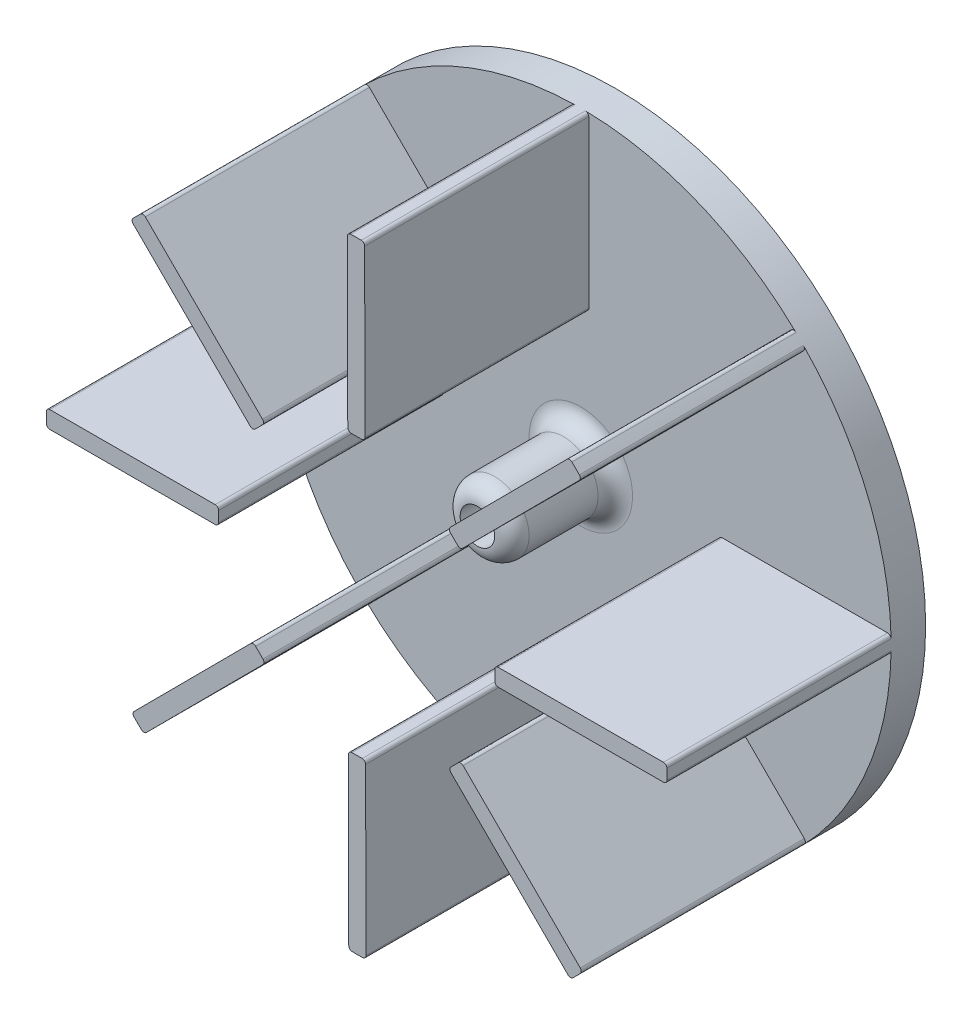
ISO-10303-21;
HEADER;
FILE_DESCRIPTION(('STEP AP214'),'2;1');
FILE_NAME('part.step','',(''),(''),'','','');
FILE_SCHEMA(('AUTOMOTIVE_DESIGN { 1 0 10303 214 1 1 1 1 }'));
ENDSEC;
DATA;
#1=APPLICATION_CONTEXT('core data for automotive mechanical design processes');
#2=APPLICATION_PROTOCOL_DEFINITION('international standard','automotive_design',2000,#1);
#3=PRODUCT_CONTEXT('',#1,'mechanical');
#4=PRODUCT('Part','Part','',(#3));
#5=PRODUCT_RELATED_PRODUCT_CATEGORY('part','',(#4));
#6=PRODUCT_DEFINITION_FORMATION('','',#4);
#7=PRODUCT_DEFINITION_CONTEXT('part definition',#1,'design');
#8=PRODUCT_DEFINITION('design','',#6,#7);
#9=PRODUCT_DEFINITION_SHAPE('','',#8);
#10=(LENGTH_UNIT() NAMED_UNIT(*) SI_UNIT(.MILLI.,.METRE.));
#11=(NAMED_UNIT(*) PLANE_ANGLE_UNIT() SI_UNIT($,.RADIAN.));
#12=(NAMED_UNIT(*) SI_UNIT($,.STERADIAN.) SOLID_ANGLE_UNIT());
#13=UNCERTAINTY_MEASURE_WITH_UNIT(LENGTH_MEASURE(1.E-05),#10,'distance_accuracy_value','');
#14=(GEOMETRIC_REPRESENTATION_CONTEXT(3) GLOBAL_UNCERTAINTY_ASSIGNED_CONTEXT((#13)) GLOBAL_UNIT_ASSIGNED_CONTEXT((#10,
#11,#12)) REPRESENTATION_CONTEXT('',''));
#15=CARTESIAN_POINT('',(0.,0.,0.));
#16=DIRECTION('',(0.,0.,1.));
#17=DIRECTION('',(1.,0.,0.));
#18=AXIS2_PLACEMENT_3D('',#15,#16,#17);
#19=CARTESIAN_POINT('',(0.,0.,0.));
#20=DIRECTION('',(0.,0.,1.));
#21=DIRECTION('',(1.,0.,0.));
#22=AXIS2_PLACEMENT_3D('',#19,#20,#21);
#23=PLANE('',#22);
#24=CARTESIAN_POINT('',(0.,0.,0.));
#25=DIRECTION('',(0.,0.,1.));
#26=DIRECTION('',(1.,0.,0.));
#27=AXIS2_PLACEMENT_3D('',#24,#25,#26);
#28=CIRCLE('',#27,3.);
#29=CARTESIAN_POINT('',(3.,0.,0.));
#30=VERTEX_POINT('',#29);
#31=EDGE_CURVE('E511',#30,#30,#28,.F.);
#32=ORIENTED_EDGE('',*,*,#31,.T.);
#33=EDGE_LOOP('',(#32));
#34=FACE_BOUND('',#33,.T.);
#35=CARTESIAN_POINT('',(0.,0.,0.));
#36=DIRECTION('',(0.,0.,1.));
#37=DIRECTION('',(1.,0.,0.));
#38=AXIS2_PLACEMENT_3D('',#35,#36,#37);
#39=CIRCLE('',#38,18.);
#40=CARTESIAN_POINT('',(12.4831508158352,12.9680740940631,0.));
#41=VERTEX_POINT('',#40);
#42=CARTESIAN_POINT('',(0.263847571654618,17.9980661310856,0.));
#43=VERTEX_POINT('',#42);
#44=EDGE_CURVE('E59',#41,#43,#39,.T.);
#45=ORIENTED_EDGE('',*,*,#44,.T.);
#46=CARTESIAN_POINT('',(0.260915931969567,17.798087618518,0.));
#47=DIRECTION('',(0.,0.,1.));
#48=DIRECTION('',(1.,0.,0.));
#49=AXIS2_PLACEMENT_3D('',#46,#47,#48);
#50=CIRCLE('',#49,0.2);
#51=CARTESIAN_POINT('',(0.460915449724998,17.7985268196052,0.));
#52=VERTEX_POINT('',#51);
#53=EDGE_CURVE('E52',#43,#52,#50,.F.);
#54=ORIENTED_EDGE('',*,*,#53,.T.);
#55=DIRECTION('',(-0.00219600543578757,0.999997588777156,0.));
#56=VECTOR('',#55,1.);
#57=CARTESIAN_POINT('',(0.482412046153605,8.00959631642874,0.));
#58=LINE('',#57,#56);
#59=CARTESIAN_POINT('',(0.481972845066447,8.20959583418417,0.));
#60=VERTEX_POINT('',#59);
#61=EDGE_CURVE('E920',#60,#52,#58,.T.);
#62=ORIENTED_EDGE('',*,*,#61,.F.);
#63=CARTESIAN_POINT('',(0.281973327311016,8.20915663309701,0.));
#64=DIRECTION('',(0.,0.,1.));
#65=DIRECTION('',(1.,0.,0.));
#66=AXIS2_PLACEMENT_3D('',#63,#64,#65);
#67=CIRCLE('',#66,0.2);
#68=CARTESIAN_POINT('',(0.282412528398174,8.00915711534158,0.));
#69=VERTEX_POINT('',#68);
#70=EDGE_CURVE('E915',#60,#69,#67,.F.);
#71=ORIENTED_EDGE('',*,*,#70,.T.);
#72=DIRECTION('',(0.999997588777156,0.0021960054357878,0.));
#73=VECTOR('',#72,1.);
#74=CARTESIAN_POINT('',(-0.517585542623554,8.00740031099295,0.));
#75=LINE('',#74,#73);
#76=CARTESIAN_POINT('',(-0.317586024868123,8.00783951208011,0.));
#77=VERTEX_POINT('',#76);
#78=EDGE_CURVE('E931',#77,#69,#75,.T.);
#79=ORIENTED_EDGE('',*,*,#78,.F.);
#80=CARTESIAN_POINT('',(-0.31802522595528,8.20783902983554,0.));
#81=DIRECTION('',(0.,0.,1.));
#82=DIRECTION('',(1.,0.,0.));
#83=AXIS2_PLACEMENT_3D('',#80,#81,#82);
#84=CIRCLE('',#83,0.2);
#85=CARTESIAN_POINT('',(-0.518024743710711,8.20739982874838,0.));
#86=VERTEX_POINT('',#85);
#87=EDGE_CURVE('E912',#77,#86,#84,.F.);
#88=ORIENTED_EDGE('',*,*,#87,.T.);
#89=DIRECTION('',(0.0021960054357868,-0.999997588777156,0.));
#90=VECTOR('',#89,1.);
#91=CARTESIAN_POINT('',(-0.517585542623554,8.00740031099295,0.));
#92=LINE('',#91,#90);
#93=CARTESIAN_POINT('',(-0.539082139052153,17.7963308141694,0.));
#94=VERTEX_POINT('',#93);
#95=EDGE_CURVE('E930',#94,#86,#92,.T.);
#96=ORIENTED_EDGE('',*,*,#95,.F.);
#97=CARTESIAN_POINT('',(-0.339082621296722,17.7967700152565,0.));
#98=DIRECTION('',(0.,0.,1.));
#99=DIRECTION('',(1.,0.,0.));
#100=AXIS2_PLACEMENT_3D('',#97,#98,#99);
#101=CIRCLE('',#100,0.2);
#102=CARTESIAN_POINT('',(-0.342892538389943,17.9967337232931,0.));
#103=VERTEX_POINT('',#102);
#104=EDGE_CURVE('E11',#94,#103,#101,.F.);
#105=ORIENTED_EDGE('',*,*,#104,.T.);
#106=CARTESIAN_POINT('',(-12.539986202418,12.9131230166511,0.));
#107=VERTEX_POINT('',#106);
#108=EDGE_CURVE('E67',#103,#107,#39,.T.);
#109=ORIENTED_EDGE('',*,*,#108,.T.);
#110=CARTESIAN_POINT('',(-12.4006530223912,12.7696438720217,0.));
#111=DIRECTION('',(0.,0.,1.));
#112=DIRECTION('',(1.,0.,0.));
#113=AXIS2_PLACEMENT_3D('',#110,#111,#112);
#114=CIRCLE('',#113,0.2);
#115=CARTESIAN_POINT('',(-12.2595425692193,12.9113754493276,0.));
#116=VERTEX_POINT('',#115);
#117=EDGE_CURVE('E865',#107,#116,#114,.F.);
#118=ORIENTED_EDGE('',*,*,#117,.T.);
#119=DIRECTION('',(-0.708657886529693,0.705552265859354,0.));
#120=VECTOR('',#119,1.);
#121=CARTESIAN_POINT('',(-5.32252304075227,6.00475669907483,0.));
#122=LINE('',#121,#120);
#123=CARTESIAN_POINT('',(-5.46425461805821,6.14586715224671,0.));
#124=VERTEX_POINT('',#123);
#125=EDGE_CURVE('E983',#124,#116,#122,.T.);
#126=ORIENTED_EDGE('',*,*,#125,.F.);
#127=CARTESIAN_POINT('',(-5.60536507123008,6.00413557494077,0.));
#128=DIRECTION('',(0.,0.,1.));
#129=DIRECTION('',(1.,0.,0.));
#130=AXIS2_PLACEMENT_3D('',#127,#128,#129);
#131=CIRCLE('',#130,0.2);
#132=CARTESIAN_POINT('',(-5.46363349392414,5.8630251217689,0.));
#133=VERTEX_POINT('',#132);
#134=EDGE_CURVE('E862',#124,#133,#131,.F.);
#135=ORIENTED_EDGE('',*,*,#134,.T.);
#136=DIRECTION('',(0.705552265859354,0.708657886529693,0.));
#137=VECTOR('',#136,1.);
#138=CARTESIAN_POINT('',(-6.02807530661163,5.29609881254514,0.));
#139=LINE('',#138,#137);
#140=CARTESIAN_POINT('',(-5.88696485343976,5.43783038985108,0.));
#141=VERTEX_POINT('',#140);
#142=EDGE_CURVE('E950',#141,#133,#139,.T.);
#143=ORIENTED_EDGE('',*,*,#142,.F.);
#144=CARTESIAN_POINT('',(-6.02869643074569,5.57894084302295,0.));
#145=DIRECTION('',(0.,0.,1.));
#146=DIRECTION('',(1.,0.,0.));
#147=AXIS2_PLACEMENT_3D('',#144,#145,#146);
#148=CIRCLE('',#147,0.2);
#149=CARTESIAN_POINT('',(-6.16980688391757,5.43720926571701,0.));
#150=VERTEX_POINT('',#149);
#151=EDGE_CURVE('E859',#141,#150,#148,.F.);
#152=ORIENTED_EDGE('',*,*,#151,.T.);
#153=DIRECTION('',(0.708657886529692,-0.705552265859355,0.));
#154=VECTOR('',#153,1.);
#155=CARTESIAN_POINT('',(-6.02807530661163,5.29609881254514,0.));
#156=LINE('',#155,#154);
#157=CARTESIAN_POINT('',(-12.9650948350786,12.2027175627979,0.));
#158=VERTEX_POINT('',#157);
#159=EDGE_CURVE('E967',#158,#150,#156,.T.);
#160=ORIENTED_EDGE('',*,*,#159,.F.);
#161=CARTESIAN_POINT('',(-12.8239843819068,12.3444491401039,0.));
#162=DIRECTION('',(0.,0.,1.));
#163=DIRECTION('',(1.,0.,0.));
#164=AXIS2_PLACEMENT_3D('',#161,#162,#163);
#165=CIRCLE('',#164,0.2);
#166=CARTESIAN_POINT('',(-12.968074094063,12.4831508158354,0.));
#167=VERTEX_POINT('',#166);
#168=EDGE_CURVE('E868',#158,#167,#165,.F.);
#169=ORIENTED_EDGE('',*,*,#168,.T.);
#170=CARTESIAN_POINT('',(-17.9980661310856,0.263847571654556,0.));
#171=VERTEX_POINT('',#170);
#172=EDGE_CURVE('E1448',#167,#171,#39,.T.);
#173=ORIENTED_EDGE('',*,*,#172,.T.);
#174=CARTESIAN_POINT('',(-17.798087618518,0.260915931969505,0.));
#175=DIRECTION('',(0.,0.,1.));
#176=DIRECTION('',(1.,0.,0.));
#177=AXIS2_PLACEMENT_3D('',#174,#175,#176);
#178=CIRCLE('',#177,0.2);
#179=CARTESIAN_POINT('',(-17.7985268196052,0.460915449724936,0.));
#180=VERTEX_POINT('',#179);
#181=EDGE_CURVE('E813',#171,#180,#178,.F.);
#182=ORIENTED_EDGE('',*,*,#181,.T.);
#183=DIRECTION('',(-0.999997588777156,-0.00219600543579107,0.));
#184=VECTOR('',#183,1.);
#185=CARTESIAN_POINT('',(-8.00959631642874,0.482412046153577,0.));
#186=LINE('',#185,#184);
#187=CARTESIAN_POINT('',(-8.20959583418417,0.481972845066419,0.));
#188=VERTEX_POINT('',#187);
#189=EDGE_CURVE('E1011',#188,#180,#186,.T.);
#190=ORIENTED_EDGE('',*,*,#189,.F.);
#191=CARTESIAN_POINT('',(-8.20915663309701,0.281973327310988,0.));
#192=DIRECTION('',(0.,0.,1.));
#193=DIRECTION('',(1.,0.,0.));
#194=AXIS2_PLACEMENT_3D('',#191,#192,#193);
#195=CIRCLE('',#194,0.2);
#196=CARTESIAN_POINT('',(-8.00915711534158,0.282412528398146,0.));
#197=VERTEX_POINT('',#196);
#198=EDGE_CURVE('E810',#188,#197,#195,.F.);
#199=ORIENTED_EDGE('',*,*,#198,.T.);
#200=DIRECTION('',(-0.00219600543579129,0.999997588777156,0.));
#201=VECTOR('',#200,1.);
#202=CARTESIAN_POINT('',(-8.00740031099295,-0.517585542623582,0.));
#203=LINE('',#202,#201);
#204=CARTESIAN_POINT('',(-8.00783951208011,-0.31758602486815,0.));
#205=VERTEX_POINT('',#204);
#206=EDGE_CURVE('E979',#205,#197,#203,.T.);
#207=ORIENTED_EDGE('',*,*,#206,.F.);
#208=CARTESIAN_POINT('',(-8.20783902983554,-0.318025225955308,0.));
#209=DIRECTION('',(0.,0.,1.));
#210=DIRECTION('',(1.,0.,0.));
#211=AXIS2_PLACEMENT_3D('',#208,#209,#210);
#212=CIRCLE('',#211,0.2);
#213=CARTESIAN_POINT('',(-8.20739982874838,-0.51802474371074,0.));
#214=VERTEX_POINT('',#213);
#215=EDGE_CURVE('E807',#205,#214,#212,.F.);
#216=ORIENTED_EDGE('',*,*,#215,.T.);
#217=DIRECTION('',(0.999997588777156,0.00219600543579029,0.));
#218=VECTOR('',#217,1.);
#219=CARTESIAN_POINT('',(-8.00740031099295,-0.517585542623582,0.));
#220=LINE('',#219,#218);
#221=CARTESIAN_POINT('',(-17.7963308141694,-0.539082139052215,0.));
#222=VERTEX_POINT('',#221);
#223=EDGE_CURVE('E995',#222,#214,#220,.T.);
#224=ORIENTED_EDGE('',*,*,#223,.F.);
#225=CARTESIAN_POINT('',(-17.7967700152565,-0.339082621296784,0.));
#226=DIRECTION('',(0.,0.,1.));
#227=DIRECTION('',(1.,0.,0.));
#228=AXIS2_PLACEMENT_3D('',#225,#226,#227);
#229=CIRCLE('',#228,0.2);
#230=CARTESIAN_POINT('',(-17.9967337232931,-0.342892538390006,0.));
#231=VERTEX_POINT('',#230);
#232=EDGE_CURVE('E816',#222,#231,#229,.F.);
#233=ORIENTED_EDGE('',*,*,#232,.T.);
#234=CARTESIAN_POINT('',(-12.913123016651,-12.5399862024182,0.));
#235=VERTEX_POINT('',#234);
#236=EDGE_CURVE('E1470',#231,#235,#39,.T.);
#237=ORIENTED_EDGE('',*,*,#236,.T.);
#238=CARTESIAN_POINT('',(-12.7696438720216,-12.4006530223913,0.));
#239=DIRECTION('',(0.,0.,1.));
#240=DIRECTION('',(1.,0.,0.));
#241=AXIS2_PLACEMENT_3D('',#238,#239,#240);
#242=CIRCLE('',#241,0.2);
#243=CARTESIAN_POINT('',(-12.9113754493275,-12.2595425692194,0.));
#244=VERTEX_POINT('',#243);
#245=EDGE_CURVE('E760',#235,#244,#242,.F.);
#246=ORIENTED_EDGE('',*,*,#245,.T.);
#247=DIRECTION('',(-0.705552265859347,-0.7086578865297,0.));
#248=VECTOR('',#247,1.);
#249=CARTESIAN_POINT('',(-6.00475669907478,-5.32252304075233,0.));
#250=LINE('',#249,#248);
#251=CARTESIAN_POINT('',(-6.14586715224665,-5.46425461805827,0.));
#252=VERTEX_POINT('',#251);
#253=EDGE_CURVE('E1039',#252,#244,#250,.T.);
#254=ORIENTED_EDGE('',*,*,#253,.F.);
#255=CARTESIAN_POINT('',(-6.00413557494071,-5.60536507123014,0.));
#256=DIRECTION('',(0.,0.,1.));
#257=DIRECTION('',(1.,0.,0.));
#258=AXIS2_PLACEMENT_3D('',#255,#256,#257);
#259=CIRCLE('',#258,0.2);
#260=CARTESIAN_POINT('',(-5.86302512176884,-5.4636334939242,0.));
#261=VERTEX_POINT('',#260);
#262=EDGE_CURVE('E757',#252,#261,#259,.F.);
#263=ORIENTED_EDGE('',*,*,#262,.T.);
#264=DIRECTION('',(-0.7086578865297,0.705552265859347,0.));
#265=VECTOR('',#264,1.);
#266=CARTESIAN_POINT('',(-5.29609881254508,-6.02807530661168,0.));
#267=LINE('',#266,#265);
#268=CARTESIAN_POINT('',(-5.43783038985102,-5.88696485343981,0.));
#269=VERTEX_POINT('',#268);
#270=EDGE_CURVE('E1007',#269,#261,#267,.T.);
#271=ORIENTED_EDGE('',*,*,#270,.F.);
#272=CARTESIAN_POINT('',(-5.57894084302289,-6.02869643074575,0.));
#273=DIRECTION('',(0.,0.,1.));
#274=DIRECTION('',(1.,0.,0.));
#275=AXIS2_PLACEMENT_3D('',#272,#273,#274);
#276=CIRCLE('',#275,0.2);
#277=CARTESIAN_POINT('',(-5.43720926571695,-6.16980688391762,0.));
#278=VERTEX_POINT('',#277);
#279=EDGE_CURVE('E754',#269,#278,#276,.F.);
#280=ORIENTED_EDGE('',*,*,#279,.T.);
#281=DIRECTION('',(0.705552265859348,0.7086578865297,0.));
#282=VECTOR('',#281,1.);
#283=CARTESIAN_POINT('',(-5.29609881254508,-6.02807530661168,0.));
#284=LINE('',#283,#282);
#285=CARTESIAN_POINT('',(-12.2027175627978,-12.9650948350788,0.));
#286=VERTEX_POINT('',#285);
#287=EDGE_CURVE('E1023',#286,#278,#284,.T.);
#288=ORIENTED_EDGE('',*,*,#287,.F.);
#289=CARTESIAN_POINT('',(-12.3444491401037,-12.8239843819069,0.));
#290=DIRECTION('',(0.,0.,1.));
#291=DIRECTION('',(1.,0.,0.));
#292=AXIS2_PLACEMENT_3D('',#289,#290,#291);
#293=CIRCLE('',#292,0.2);
#294=CARTESIAN_POINT('',(-12.4831508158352,-12.9680740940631,0.));
#295=VERTEX_POINT('',#294);
#296=EDGE_CURVE('E763',#286,#295,#293,.F.);
#297=ORIENTED_EDGE('',*,*,#296,.T.);
#298=CARTESIAN_POINT('',(-0.263847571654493,-17.9980661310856,0.));
#299=VERTEX_POINT('',#298);
#300=EDGE_CURVE('E1492',#295,#299,#39,.T.);
#301=ORIENTED_EDGE('',*,*,#300,.T.);
#302=CARTESIAN_POINT('',(-0.260915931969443,-17.798087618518,0.));
#303=DIRECTION('',(0.,0.,1.));
#304=DIRECTION('',(1.,0.,0.));
#305=AXIS2_PLACEMENT_3D('',#302,#303,#304);
#306=CIRCLE('',#305,0.2);
#307=CARTESIAN_POINT('',(-0.460915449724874,-17.7985268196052,0.));
#308=VERTEX_POINT('',#307);
#309=EDGE_CURVE('E707',#299,#308,#306,.F.);
#310=ORIENTED_EDGE('',*,*,#309,.T.);
#311=DIRECTION('',(0.00219600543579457,-0.999997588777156,0.));
#312=VECTOR('',#311,1.);
#313=CARTESIAN_POINT('',(-0.482412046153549,-8.00959631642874,0.));
#314=LINE('',#313,#312);
#315=CARTESIAN_POINT('',(-0.481972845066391,-8.20959583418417,0.));
#316=VERTEX_POINT('',#315);
#317=EDGE_CURVE('E1067',#316,#308,#314,.T.);
#318=ORIENTED_EDGE('',*,*,#317,.F.);
#319=CARTESIAN_POINT('',(-0.281973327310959,-8.20915663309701,0.));
#320=DIRECTION('',(0.,0.,1.));
#321=DIRECTION('',(1.,0.,0.));
#322=AXIS2_PLACEMENT_3D('',#319,#320,#321);
#323=CIRCLE('',#322,0.2);
#324=CARTESIAN_POINT('',(-0.282412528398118,-8.00915711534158,0.));
#325=VERTEX_POINT('',#324);
#326=EDGE_CURVE('E704',#316,#325,#323,.F.);
#327=ORIENTED_EDGE('',*,*,#326,.T.);
#328=DIRECTION('',(-0.999997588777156,-0.00219600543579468,0.));
#329=VECTOR('',#328,1.);
#330=CARTESIAN_POINT('',(0.517585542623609,-8.00740031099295,0.));
#331=LINE('',#330,#329);
#332=CARTESIAN_POINT('',(0.317586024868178,-8.00783951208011,0.));
#333=VERTEX_POINT('',#332);
#334=EDGE_CURVE('E1035',#333,#325,#331,.T.);
#335=ORIENTED_EDGE('',*,*,#334,.F.);
#336=CARTESIAN_POINT('',(0.318025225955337,-8.20783902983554,0.));
#337=DIRECTION('',(0.,0.,1.));
#338=DIRECTION('',(1.,0.,0.));
#339=AXIS2_PLACEMENT_3D('',#336,#337,#338);
#340=CIRCLE('',#339,0.2);
#341=CARTESIAN_POINT('',(0.518024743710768,-8.20739982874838,0.));
#342=VERTEX_POINT('',#341);
#343=EDGE_CURVE('E701',#333,#342,#340,.F.);
#344=ORIENTED_EDGE('',*,*,#343,.T.);
#345=DIRECTION('',(-0.00219600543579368,0.999997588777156,0.));
#346=VECTOR('',#345,1.);
#347=CARTESIAN_POINT('',(0.517585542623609,-8.00740031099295,0.));
#348=LINE('',#347,#346);
#349=CARTESIAN_POINT('',(0.539082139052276,-17.7963308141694,0.));
#350=VERTEX_POINT('',#349);
#351=EDGE_CURVE('E1051',#350,#342,#348,.T.);
#352=ORIENTED_EDGE('',*,*,#351,.F.);
#353=CARTESIAN_POINT('',(0.339082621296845,-17.7967700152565,0.));
#354=DIRECTION('',(0.,0.,1.));
#355=DIRECTION('',(1.,0.,0.));
#356=AXIS2_PLACEMENT_3D('',#353,#354,#355);
#357=CIRCLE('',#356,0.2);
#358=CARTESIAN_POINT('',(0.342892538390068,-17.9967337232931,0.));
#359=VERTEX_POINT('',#358);
#360=EDGE_CURVE('E710',#350,#359,#357,.F.);
#361=ORIENTED_EDGE('',*,*,#360,.T.);
#362=CARTESIAN_POINT('',(12.5399862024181,-12.9131230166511,0.));
#363=VERTEX_POINT('',#362);
#364=EDGE_CURVE('E1514',#359,#363,#39,.T.);
#365=ORIENTED_EDGE('',*,*,#364,.T.);
#366=CARTESIAN_POINT('',(12.4006530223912,-12.7696438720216,0.));
#367=DIRECTION('',(0.,0.,1.));
#368=DIRECTION('',(1.,0.,0.));
#369=AXIS2_PLACEMENT_3D('',#366,#367,#368);
#370=CIRCLE('',#369,0.2);
#371=CARTESIAN_POINT('',(12.2595425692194,-12.9113754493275,0.));
#372=VERTEX_POINT('',#371);
#373=EDGE_CURVE('E654',#363,#372,#370,.F.);
#374=ORIENTED_EDGE('',*,*,#373,.T.);
#375=DIRECTION('',(0.708657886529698,-0.705552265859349,0.));
#376=VECTOR('',#375,1.);
#377=CARTESIAN_POINT('',(5.32252304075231,-6.0047566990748,0.));
#378=LINE('',#377,#376);
#379=CARTESIAN_POINT('',(5.46425461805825,-6.14586715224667,0.));
#380=VERTEX_POINT('',#379);
#381=EDGE_CURVE('E1095',#380,#372,#378,.T.);
#382=ORIENTED_EDGE('',*,*,#381,.F.);
#383=CARTESIAN_POINT('',(5.60536507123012,-6.00413557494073,0.));
#384=DIRECTION('',(0.,0.,1.));
#385=DIRECTION('',(1.,0.,0.));
#386=AXIS2_PLACEMENT_3D('',#383,#384,#385);
#387=CIRCLE('',#386,0.2);
#388=CARTESIAN_POINT('',(5.46363349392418,-5.86302512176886,0.));
#389=VERTEX_POINT('',#388);
#390=EDGE_CURVE('E651',#380,#389,#387,.F.);
#391=ORIENTED_EDGE('',*,*,#390,.T.);
#392=DIRECTION('',(-0.705552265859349,-0.708657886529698,0.));
#393=VECTOR('',#392,1.);
#394=CARTESIAN_POINT('',(6.02807530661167,-5.2960988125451,0.));
#395=LINE('',#394,#393);
#396=CARTESIAN_POINT('',(5.8869648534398,-5.43783038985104,0.));
#397=VERTEX_POINT('',#396);
#398=EDGE_CURVE('E1063',#397,#389,#395,.T.);
#399=ORIENTED_EDGE('',*,*,#398,.F.);
#400=CARTESIAN_POINT('',(6.02869643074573,-5.57894084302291,0.));
#401=DIRECTION('',(0.,0.,1.));
#402=DIRECTION('',(1.,0.,0.));
#403=AXIS2_PLACEMENT_3D('',#400,#401,#402);
#404=CIRCLE('',#403,0.2);
#405=CARTESIAN_POINT('',(6.1698068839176,-5.43720926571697,0.));
#406=VERTEX_POINT('',#405);
#407=EDGE_CURVE('E648',#397,#406,#404,.F.);
#408=ORIENTED_EDGE('',*,*,#407,.T.);
#409=DIRECTION('',(-0.708657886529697,0.70555226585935,0.));
#410=VECTOR('',#409,1.);
#411=CARTESIAN_POINT('',(6.02807530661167,-5.2960988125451,0.));
#412=LINE('',#411,#410);
#413=CARTESIAN_POINT('',(12.9650948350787,-12.2027175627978,0.));
#414=VERTEX_POINT('',#413);
#415=EDGE_CURVE('E1079',#414,#406,#412,.T.);
#416=ORIENTED_EDGE('',*,*,#415,.F.);
#417=CARTESIAN_POINT('',(12.8239843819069,-12.3444491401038,0.));
#418=DIRECTION('',(0.,0.,1.));
#419=DIRECTION('',(1.,0.,0.));
#420=AXIS2_PLACEMENT_3D('',#417,#418,#419);
#421=CIRCLE('',#420,0.2);
#422=CARTESIAN_POINT('',(12.9680740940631,-12.4831508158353,0.));
#423=VERTEX_POINT('',#422);
#424=EDGE_CURVE('E657',#414,#423,#421,.F.);
#425=ORIENTED_EDGE('',*,*,#424,.T.);
#426=CARTESIAN_POINT('',(17.9980661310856,-0.263847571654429,0.));
#427=VERTEX_POINT('',#426);
#428=EDGE_CURVE('E1536',#423,#427,#39,.T.);
#429=ORIENTED_EDGE('',*,*,#428,.T.);
#430=CARTESIAN_POINT('',(17.798087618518,-0.26091593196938,0.));
#431=DIRECTION('',(0.,0.,1.));
#432=DIRECTION('',(1.,0.,0.));
#433=AXIS2_PLACEMENT_3D('',#430,#431,#432);
#434=CIRCLE('',#433,0.2);
#435=CARTESIAN_POINT('',(17.7985268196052,-0.460915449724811,0.));
#436=VERTEX_POINT('',#435);
#437=EDGE_CURVE('E601',#427,#436,#434,.F.);
#438=ORIENTED_EDGE('',*,*,#437,.T.);
#439=DIRECTION('',(0.999997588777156,0.00219600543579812,0.));
#440=VECTOR('',#439,1.);
#441=CARTESIAN_POINT('',(8.00959631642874,-0.482412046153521,0.));
#442=LINE('',#441,#440);
#443=CARTESIAN_POINT('',(8.20959583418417,-0.481972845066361,0.));
#444=VERTEX_POINT('',#443);
#445=EDGE_CURVE('E1117',#444,#436,#442,.T.);
#446=ORIENTED_EDGE('',*,*,#445,.F.);
#447=CARTESIAN_POINT('',(8.20915663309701,-0.28197332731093,0.));
#448=DIRECTION('',(0.,0.,1.));
#449=DIRECTION('',(1.,0.,0.));
#450=AXIS2_PLACEMENT_3D('',#447,#448,#449);
#451=CIRCLE('',#450,0.2);
#452=CARTESIAN_POINT('',(8.00915711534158,-0.28241252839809,0.));
#453=VERTEX_POINT('',#452);
#454=EDGE_CURVE('E598',#444,#453,#451,.F.);
#455=ORIENTED_EDGE('',*,*,#454,.T.);
#456=DIRECTION('',(0.00219600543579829,-0.999997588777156,0.));
#457=VECTOR('',#456,1.);
#458=CARTESIAN_POINT('',(8.00740031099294,0.517585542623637,0.));
#459=LINE('',#458,#457);
#460=CARTESIAN_POINT('',(8.00783951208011,0.317586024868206,0.));
#461=VERTEX_POINT('',#460);
#462=EDGE_CURVE('E1091',#461,#453,#459,.T.);
#463=ORIENTED_EDGE('',*,*,#462,.F.);
#464=CARTESIAN_POINT('',(8.20783902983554,0.318025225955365,0.));
#465=DIRECTION('',(0.,0.,1.));
#466=DIRECTION('',(1.,0.,0.));
#467=AXIS2_PLACEMENT_3D('',#464,#465,#466);
#468=CIRCLE('',#467,0.2);
#469=CARTESIAN_POINT('',(8.20739982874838,0.518024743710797,0.));
#470=VERTEX_POINT('',#469);
#471=EDGE_CURVE('E595',#461,#470,#468,.F.);
#472=ORIENTED_EDGE('',*,*,#471,.T.);
#473=DIRECTION('',(-0.999997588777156,-0.00219600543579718,0.));
#474=VECTOR('',#473,1.);
#475=CARTESIAN_POINT('',(8.00740031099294,0.517585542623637,0.));
#476=LINE('',#475,#474);
#477=CARTESIAN_POINT('',(17.7963308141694,0.539082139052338,0.));
#478=VERTEX_POINT('',#477);
#479=EDGE_CURVE('E1107',#478,#470,#476,.T.);
#480=ORIENTED_EDGE('',*,*,#479,.F.);
#481=CARTESIAN_POINT('',(17.7967700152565,0.339082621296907,0.));
#482=DIRECTION('',(0.,0.,1.));
#483=DIRECTION('',(1.,0.,0.));
#484=AXIS2_PLACEMENT_3D('',#481,#482,#483);
#485=CIRCLE('',#484,0.2);
#486=CARTESIAN_POINT('',(17.9967337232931,0.34289253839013,0.));
#487=VERTEX_POINT('',#486);
#488=EDGE_CURVE('E604',#478,#487,#485,.F.);
#489=ORIENTED_EDGE('',*,*,#488,.T.);
#490=CARTESIAN_POINT('',(12.913123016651,12.5399862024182,0.));
#491=VERTEX_POINT('',#490);
#492=EDGE_CURVE('E496',#487,#491,#39,.T.);
#493=ORIENTED_EDGE('',*,*,#492,.T.);
#494=CARTESIAN_POINT('',(12.7696438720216,12.4006530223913,0.));
#495=DIRECTION('',(0.,0.,1.));
#496=DIRECTION('',(1.,0.,0.));
#497=AXIS2_PLACEMENT_3D('',#494,#495,#496);
#498=CIRCLE('',#497,0.2);
#499=CARTESIAN_POINT('',(12.9113754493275,12.2595425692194,0.));
#500=VERTEX_POINT('',#499);
#501=EDGE_CURVE('E549',#491,#500,#498,.F.);
#502=ORIENTED_EDGE('',*,*,#501,.T.);
#503=DIRECTION('',(0.705552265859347,0.7086578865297,0.));
#504=VECTOR('',#503,1.);
#505=CARTESIAN_POINT('',(6.00475669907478,5.32252304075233,0.));
#506=LINE('',#505,#504);
#507=CARTESIAN_POINT('',(6.14586715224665,5.46425461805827,0.));
#508=VERTEX_POINT('',#507);
#509=EDGE_CURVE('E471',#508,#500,#506,.T.);
#510=ORIENTED_EDGE('',*,*,#509,.F.);
#511=CARTESIAN_POINT('',(6.00413557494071,5.60536507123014,0.));
#512=DIRECTION('',(0.,0.,1.));
#513=DIRECTION('',(1.,0.,0.));
#514=AXIS2_PLACEMENT_3D('',#511,#512,#513);
#515=CIRCLE('',#514,0.2);
#516=CARTESIAN_POINT('',(5.86302512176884,5.4636334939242,0.));
#517=VERTEX_POINT('',#516);
#518=EDGE_CURVE('E454',#508,#517,#515,.F.);
#519=ORIENTED_EDGE('',*,*,#518,.T.);
#520=DIRECTION('',(0.7086578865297,-0.705552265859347,0.));
#521=VECTOR('',#520,1.);
#522=CARTESIAN_POINT('',(5.29609881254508,6.02807530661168,0.));
#523=LINE('',#522,#521);
#524=CARTESIAN_POINT('',(5.43783038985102,5.88696485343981,0.));
#525=VERTEX_POINT('',#524);
#526=EDGE_CURVE('E461',#525,#517,#523,.T.);
#527=ORIENTED_EDGE('',*,*,#526,.F.);
#528=CARTESIAN_POINT('',(5.57894084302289,6.02869643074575,0.));
#529=DIRECTION('',(0.,0.,1.));
#530=DIRECTION('',(1.,0.,0.));
#531=AXIS2_PLACEMENT_3D('',#528,#529,#530);
#532=CIRCLE('',#531,0.2);
#533=CARTESIAN_POINT('',(5.43720926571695,6.16980688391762,0.));
#534=VERTEX_POINT('',#533);
#535=EDGE_CURVE('E444',#525,#534,#532,.F.);
#536=ORIENTED_EDGE('',*,*,#535,.T.);
#537=DIRECTION('',(-0.705552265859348,-0.7086578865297,0.));
#538=VECTOR('',#537,1.);
#539=CARTESIAN_POINT('',(5.29609881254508,6.02807530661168,0.));
#540=LINE('',#539,#538);
#541=CARTESIAN_POINT('',(12.2027175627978,12.9650948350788,0.));
#542=VERTEX_POINT('',#541);
#543=EDGE_CURVE('E477',#542,#534,#540,.T.);
#544=ORIENTED_EDGE('',*,*,#543,.F.);
#545=CARTESIAN_POINT('',(12.3444491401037,12.8239843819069,0.));
#546=DIRECTION('',(0.,0.,1.));
#547=DIRECTION('',(1.,0.,0.));
#548=AXIS2_PLACEMENT_3D('',#545,#546,#547);
#549=CIRCLE('',#548,0.2);
#550=EDGE_CURVE('E552',#542,#41,#549,.F.);
#551=ORIENTED_EDGE('',*,*,#550,.T.);
#552=EDGE_LOOP('',(#45,#54,#62,#71,#79,#88,#96,#105,#109,#118,#126,#135,#143,#152,#160,#169,
#173,#182,#190,#199,#207,#216,#224,#233,#237,#246,#254,#263,#271,#280,#288,#297,#301,#310,#318,
#327,#335,#344,#352,#361,#365,#374,#382,#391,#399,#408,#416,#425,#429,#438,#446,#455,#463,#472,
#480,#489,#493,#502,#510,#519,#527,#536,#544,#551));
#553=FACE_BOUND('',#552,.T.);
#554=ADVANCED_FACE('F43',(#34,#553),#23,.T.);
#555=CARTESIAN_POINT('',(0.,0.,-2.));
#556=DIRECTION('',(0.,0.,1.));
#557=DIRECTION('',(1.,0.,0.));
#558=AXIS2_PLACEMENT_3D('',#555,#556,#557);
#559=CYLINDRICAL_SURFACE('',#558,18.);
#560=CARTESIAN_POINT('',(0.,0.,-2.));
#561=DIRECTION('',(0.,0.,1.));
#562=DIRECTION('',(1.,0.,0.));
#563=AXIS2_PLACEMENT_3D('',#560,#561,#562);
#564=CIRCLE('',#563,18.);
#565=CARTESIAN_POINT('',(18.,0.,-2.));
#566=VERTEX_POINT('',#565);
#567=EDGE_CURVE('E497',#566,#566,#564,.T.);
#568=ORIENTED_EDGE('',*,*,#567,.T.);
#569=EDGE_LOOP('',(#568));
#570=FACE_BOUND('',#569,.T.);
#571=CARTESIAN_POINT('',(0.,0.,13.));
#572=DIRECTION('',(0.,0.,1.));
#573=DIRECTION('',(0.707106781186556,0.707106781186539,0.));
#574=AXIS2_PLACEMENT_3D('',#571,#572,#573);
#575=CIRCLE('',#574,18.);
#576=CARTESIAN_POINT('',(0.263847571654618,17.9980661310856,13.));
#577=VERTEX_POINT('',#576);
#578=CARTESIAN_POINT('',(-0.342892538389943,17.9967337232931,13.));
#579=VERTEX_POINT('',#578);
#580=EDGE_CURVE('E940',#577,#579,#575,.T.);
#581=ORIENTED_EDGE('',*,*,#580,.F.);
#582=DIRECTION('',(0.,0.,1.));
#583=VECTOR('',#582,1.);
#584=CARTESIAN_POINT('',(0.263847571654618,17.9980661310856,-2.));
#585=LINE('',#584,#583);
#586=EDGE_CURVE('E908',#577,#43,#585,.F.);
#587=ORIENTED_EDGE('',*,*,#586,.T.);
#588=ORIENTED_EDGE('',*,*,#44,.F.);
#589=DIRECTION('',(0.,0.,1.));
#590=VECTOR('',#589,1.);
#591=CARTESIAN_POINT('',(12.4831508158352,12.9680740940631,-2.));
#592=LINE('',#591,#590);
#593=CARTESIAN_POINT('',(12.4831508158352,12.9680740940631,13.));
#594=VERTEX_POINT('',#593);
#595=EDGE_CURVE('E541',#41,#594,#592,.T.);
#596=ORIENTED_EDGE('',*,*,#595,.T.);
#597=CARTESIAN_POINT('',(0.,0.,13.));
#598=DIRECTION('',(0.,0.,1.));
#599=DIRECTION('',(1.,0.,0.));
#600=AXIS2_PLACEMENT_3D('',#597,#598,#599);
#601=CIRCLE('',#600,18.);
#602=CARTESIAN_POINT('',(12.913123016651,12.5399862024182,13.));
#603=VERTEX_POINT('',#602);
#604=EDGE_CURVE('E1129',#603,#594,#601,.T.);
#605=ORIENTED_EDGE('',*,*,#604,.F.);
#606=DIRECTION('',(0.,0.,1.));
#607=VECTOR('',#606,1.);
#608=CARTESIAN_POINT('',(12.913123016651,12.5399862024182,-2.));
#609=LINE('',#608,#607);
#610=EDGE_CURVE('E455',#603,#491,#609,.F.);
#611=ORIENTED_EDGE('',*,*,#610,.T.);
#612=ORIENTED_EDGE('',*,*,#492,.F.);
#613=DIRECTION('',(0.,0.,1.));
#614=VECTOR('',#613,1.);
#615=CARTESIAN_POINT('',(17.9967337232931,0.34289253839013,-2.));
#616=LINE('',#615,#614);
#617=CARTESIAN_POINT('',(17.9967337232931,0.34289253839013,13.));
#618=VERTEX_POINT('',#617);
#619=EDGE_CURVE('E588',#487,#618,#616,.T.);
#620=ORIENTED_EDGE('',*,*,#619,.T.);
#621=CARTESIAN_POINT('',(0.,0.,13.));
#622=DIRECTION('',(0.,0.,1.));
#623=DIRECTION('',(0.707106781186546,-0.707106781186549,0.));
#624=AXIS2_PLACEMENT_3D('',#621,#622,#623);
#625=CIRCLE('',#624,18.);
#626=CARTESIAN_POINT('',(17.9980661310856,-0.263847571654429,13.));
#627=VERTEX_POINT('',#626);
#628=EDGE_CURVE('E480',#627,#618,#625,.T.);
#629=ORIENTED_EDGE('',*,*,#628,.F.);
#630=DIRECTION('',(0.,0.,1.));
#631=VECTOR('',#630,1.);
#632=CARTESIAN_POINT('',(17.9980661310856,-0.263847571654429,-2.));
#633=LINE('',#632,#631);
#634=EDGE_CURVE('E591',#627,#427,#633,.F.);
#635=ORIENTED_EDGE('',*,*,#634,.T.);
#636=ORIENTED_EDGE('',*,*,#428,.F.);
#637=DIRECTION('',(0.,0.,1.));
#638=VECTOR('',#637,1.);
#639=CARTESIAN_POINT('',(12.9680740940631,-12.4831508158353,-2.));
#640=LINE('',#639,#638);
#641=CARTESIAN_POINT('',(12.9680740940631,-12.4831508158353,13.));
#642=VERTEX_POINT('',#641);
#643=EDGE_CURVE('E641',#423,#642,#640,.T.);
#644=ORIENTED_EDGE('',*,*,#643,.T.);
#645=CARTESIAN_POINT('',(0.,0.,13.));
#646=DIRECTION('',(0.,0.,1.));
#647=DIRECTION('',(0.,-1.,0.));
#648=AXIS2_PLACEMENT_3D('',#645,#646,#647);
#649=CIRCLE('',#648,18.);
#650=CARTESIAN_POINT('',(12.5399862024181,-12.9131230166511,13.));
#651=VERTEX_POINT('',#650);
#652=EDGE_CURVE('E1083',#651,#642,#649,.T.);
#653=ORIENTED_EDGE('',*,*,#652,.F.);
#654=DIRECTION('',(0.,0.,1.));
#655=VECTOR('',#654,1.);
#656=CARTESIAN_POINT('',(12.5399862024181,-12.9131230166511,-2.));
#657=LINE('',#656,#655);
#658=EDGE_CURVE('E644',#651,#363,#657,.F.);
#659=ORIENTED_EDGE('',*,*,#658,.T.);
#660=ORIENTED_EDGE('',*,*,#364,.F.);
#661=DIRECTION('',(0.,0.,1.));
#662=VECTOR('',#661,1.);
#663=CARTESIAN_POINT('',(0.342892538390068,-17.9967337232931,-2.));
#664=LINE('',#663,#662);
#665=CARTESIAN_POINT('',(0.342892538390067,-17.9967337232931,13.));
#666=VERTEX_POINT('',#665);
#667=EDGE_CURVE('E694',#359,#666,#664,.T.);
#668=ORIENTED_EDGE('',*,*,#667,.T.);
#669=CARTESIAN_POINT('',(0.,0.,13.));
#670=DIRECTION('',(0.,0.,1.));
#671=DIRECTION('',(-0.707106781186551,-0.707106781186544,0.));
#672=AXIS2_PLACEMENT_3D('',#669,#670,#671);
#673=CIRCLE('',#672,18.);
#674=CARTESIAN_POINT('',(-0.263847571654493,-17.9980661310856,13.));
#675=VERTEX_POINT('',#674);
#676=EDGE_CURVE('E1055',#675,#666,#673,.T.);
#677=ORIENTED_EDGE('',*,*,#676,.F.);
#678=DIRECTION('',(0.,0.,1.));
#679=VECTOR('',#678,1.);
#680=CARTESIAN_POINT('',(-0.263847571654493,-17.9980661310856,-2.));
#681=LINE('',#680,#679);
#682=EDGE_CURVE('E697',#675,#299,#681,.F.);
#683=ORIENTED_EDGE('',*,*,#682,.T.);
#684=ORIENTED_EDGE('',*,*,#300,.F.);
#685=DIRECTION('',(0.,0.,1.));
#686=VECTOR('',#685,1.);
#687=CARTESIAN_POINT('',(-12.4831508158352,-12.9680740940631,-2.));
#688=LINE('',#687,#686);
#689=CARTESIAN_POINT('',(-12.4831508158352,-12.9680740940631,13.));
#690=VERTEX_POINT('',#689);
#691=EDGE_CURVE('E747',#295,#690,#688,.T.);
#692=ORIENTED_EDGE('',*,*,#691,.T.);
#693=CARTESIAN_POINT('',(0.,0.,13.));
#694=DIRECTION('',(0.,0.,1.));
#695=DIRECTION('',(-1.,0.,0.));
#696=AXIS2_PLACEMENT_3D('',#693,#694,#695);
#697=CIRCLE('',#696,18.);
#698=CARTESIAN_POINT('',(-12.913123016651,-12.5399862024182,13.));
#699=VERTEX_POINT('',#698);
#700=EDGE_CURVE('E1027',#699,#690,#697,.T.);
#701=ORIENTED_EDGE('',*,*,#700,.F.);
#702=DIRECTION('',(0.,0.,1.));
#703=VECTOR('',#702,1.);
#704=CARTESIAN_POINT('',(-12.913123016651,-12.5399862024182,-2.));
#705=LINE('',#704,#703);
#706=EDGE_CURVE('E750',#699,#235,#705,.F.);
#707=ORIENTED_EDGE('',*,*,#706,.T.);
#708=ORIENTED_EDGE('',*,*,#236,.F.);
#709=DIRECTION('',(0.,0.,1.));
#710=VECTOR('',#709,1.);
#711=CARTESIAN_POINT('',(-17.9967337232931,-0.342892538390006,-2.));
#712=LINE('',#711,#710);
#713=CARTESIAN_POINT('',(-17.9967337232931,-0.342892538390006,13.));
#714=VERTEX_POINT('',#713);
#715=EDGE_CURVE('E800',#231,#714,#712,.T.);
#716=ORIENTED_EDGE('',*,*,#715,.T.);
#717=CARTESIAN_POINT('',(0.,0.,13.));
#718=DIRECTION('',(0.,0.,1.));
#719=DIRECTION('',(-0.707106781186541,0.707106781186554,0.));
#720=AXIS2_PLACEMENT_3D('',#717,#718,#719);
#721=CIRCLE('',#720,18.);
#722=CARTESIAN_POINT('',(-17.9980661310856,0.263847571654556,13.));
#723=VERTEX_POINT('',#722);
#724=EDGE_CURVE('E999',#723,#714,#721,.T.);
#725=ORIENTED_EDGE('',*,*,#724,.F.);
#726=DIRECTION('',(0.,0.,1.));
#727=VECTOR('',#726,1.);
#728=CARTESIAN_POINT('',(-17.9980661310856,0.263847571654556,-2.));
#729=LINE('',#728,#727);
#730=EDGE_CURVE('E803',#723,#171,#729,.F.);
#731=ORIENTED_EDGE('',*,*,#730,.T.);
#732=ORIENTED_EDGE('',*,*,#172,.F.);
#733=DIRECTION('',(0.,0.,1.));
#734=VECTOR('',#733,1.);
#735=CARTESIAN_POINT('',(-12.968074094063,12.4831508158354,-2.));
#736=LINE('',#735,#734);
#737=CARTESIAN_POINT('',(-12.968074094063,12.4831508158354,13.));
#738=VERTEX_POINT('',#737);
#739=EDGE_CURVE('E853',#167,#738,#736,.T.);
#740=ORIENTED_EDGE('',*,*,#739,.T.);
#741=CARTESIAN_POINT('',(0.,0.,13.));
#742=DIRECTION('',(0.,0.,1.));
#743=DIRECTION('',(0.,1.,0.));
#744=AXIS2_PLACEMENT_3D('',#741,#742,#743);
#745=CIRCLE('',#744,18.);
#746=CARTESIAN_POINT('',(-12.539986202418,12.9131230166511,13.));
#747=VERTEX_POINT('',#746);
#748=EDGE_CURVE('E971',#747,#738,#745,.T.);
#749=ORIENTED_EDGE('',*,*,#748,.F.);
#750=DIRECTION('',(0.,0.,1.));
#751=VECTOR('',#750,1.);
#752=CARTESIAN_POINT('',(-12.539986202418,12.9131230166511,-2.));
#753=LINE('',#752,#751);
#754=EDGE_CURVE('E856',#747,#107,#753,.F.);
#755=ORIENTED_EDGE('',*,*,#754,.T.);
#756=ORIENTED_EDGE('',*,*,#108,.F.);
#757=DIRECTION('',(0.,0.,1.));
#758=VECTOR('',#757,1.);
#759=CARTESIAN_POINT('',(-0.342892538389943,17.9967337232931,-2.));
#760=LINE('',#759,#758);
#761=EDGE_CURVE('E905',#103,#579,#760,.T.);
#762=ORIENTED_EDGE('',*,*,#761,.T.);
#763=EDGE_LOOP('',(#581,#587,#588,#596,#605,#611,#612,#620,#629,#635,#636,#644,#653,#659,#660,
#668,#677,#683,#684,#692,#701,#707,#708,#716,#725,#731,#732,#740,#749,#755,#756,#762));
#764=FACE_BOUND('',#763,.T.);
#765=ADVANCED_FACE('F943',(#570,#764),#559,.T.);
#766=CARTESIAN_POINT('',(0.,0.,-2.));
#767=DIRECTION('',(0.,0.,1.));
#768=DIRECTION('',(1.,0.,0.));
#769=AXIS2_PLACEMENT_3D('',#766,#767,#768);
#770=PLANE('',#769);
#771=CARTESIAN_POINT('',(0.,0.,-2.));
#772=DIRECTION('',(0.,0.,1.));
#773=DIRECTION('',(1.,0.,0.));
#774=AXIS2_PLACEMENT_3D('',#771,#772,#773);
#775=CIRCLE('',#774,1.);
#776=CARTESIAN_POINT('',(1.,0.,-2.));
#777=VERTEX_POINT('',#776);
#778=EDGE_CURVE('E492',#777,#777,#775,.T.);
#779=ORIENTED_EDGE('',*,*,#778,.T.);
#780=EDGE_LOOP('',(#779));
#781=FACE_BOUND('',#780,.T.);
#782=ORIENTED_EDGE('',*,*,#567,.F.);
#783=EDGE_LOOP('',(#782));
#784=FACE_BOUND('',#783,.T.);
#785=ADVANCED_FACE('F1172',(#781,#784),#770,.F.);
#786=CARTESIAN_POINT('',(0.,0.,-2.));
#787=DIRECTION('',(0.,0.,1.));
#788=DIRECTION('',(1.,0.,0.));
#789=AXIS2_PLACEMENT_3D('',#786,#787,#788);
#790=CYLINDRICAL_SURFACE('',#789,1.);
#791=ORIENTED_EDGE('',*,*,#778,.F.);
#792=EDGE_LOOP('',(#791));
#793=FACE_BOUND('',#792,.T.);
#794=CARTESIAN_POINT('',(0.,0.,6.));
#795=DIRECTION('',(0.,0.,1.));
#796=DIRECTION('',(1.,0.,0.));
#797=AXIS2_PLACEMENT_3D('',#794,#795,#796);
#798=CIRCLE('',#797,1.);
#799=CARTESIAN_POINT('',(1.,0.,6.));
#800=VERTEX_POINT('',#799);
#801=EDGE_CURVE('E488',#800,#800,#798,.T.);
#802=ORIENTED_EDGE('',*,*,#801,.T.);
#803=EDGE_LOOP('',(#802));
#804=FACE_BOUND('',#803,.T.);
#805=ADVANCED_FACE('F1195',(#793,#804),#790,.F.);
#806=CARTESIAN_POINT('',(0.,0.,6.));
#807=DIRECTION('',(0.,0.,-1.));
#808=DIRECTION('',(-1.,0.,0.));
#809=AXIS2_PLACEMENT_3D('',#806,#807,#808);
#810=CYLINDRICAL_SURFACE('',#809,2.);
#811=CARTESIAN_POINT('',(0.,0.,5.));
#812=DIRECTION('',(0.,0.,1.));
#813=DIRECTION('',(1.,0.,0.));
#814=AXIS2_PLACEMENT_3D('',#811,#812,#813);
#815=CIRCLE('',#814,2.);
#816=CARTESIAN_POINT('',(2.,0.,5.));
#817=VERTEX_POINT('',#816);
#818=EDGE_CURVE('E507',#817,#817,#815,.F.);
#819=ORIENTED_EDGE('',*,*,#818,.T.);
#820=EDGE_LOOP('',(#819));
#821=FACE_BOUND('',#820,.T.);
#822=CARTESIAN_POINT('',(0.,0.,1.));
#823=DIRECTION('',(0.,0.,1.));
#824=DIRECTION('',(1.,0.,0.));
#825=AXIS2_PLACEMENT_3D('',#822,#823,#824);
#826=CIRCLE('',#825,2.);
#827=CARTESIAN_POINT('',(2.,0.,1.));
#828=VERTEX_POINT('',#827);
#829=EDGE_CURVE('E501',#828,#828,#826,.T.);
#830=ORIENTED_EDGE('',*,*,#829,.T.);
#831=EDGE_LOOP('',(#830));
#832=FACE_BOUND('',#831,.T.);
#833=ADVANCED_FACE('F1182',(#821,#832),#810,.T.);
#834=CARTESIAN_POINT('',(0.,0.,5.));
#835=DIRECTION('',(0.,0.,1.));
#836=DIRECTION('',(1.,0.,0.));
#837=AXIS2_PLACEMENT_3D('',#834,#835,#836);
#838=DEGENERATE_TOROIDAL_SURFACE('',#837,1.,1.,.T.);
#839=ORIENTED_EDGE('',*,*,#818,.F.);
#840=EDGE_LOOP('',(#839));
#841=FACE_BOUND('',#840,.T.);
#842=ORIENTED_EDGE('',*,*,#801,.F.);
#843=EDGE_LOOP('',(#842));
#844=FACE_BOUND('',#843,.T.);
#845=ADVANCED_FACE('F1178',(#841,#844),#838,.T.);
#846=CARTESIAN_POINT('',(0.,0.,1.));
#847=DIRECTION('',(0.,0.,1.));
#848=DIRECTION('',(1.,0.,0.));
#849=AXIS2_PLACEMENT_3D('',#846,#847,#848);
#850=TOROIDAL_SURFACE('',#849,3.,1.);
#851=ORIENTED_EDGE('',*,*,#31,.F.);
#852=EDGE_LOOP('',(#851));
#853=FACE_BOUND('',#852,.T.);
#854=ORIENTED_EDGE('',*,*,#829,.F.);
#855=EDGE_LOOP('',(#854));
#856=FACE_BOUND('',#855,.T.);
#857=ADVANCED_FACE('F1181',(#853,#856),#850,.F.);
#858=CARTESIAN_POINT('',(5.29609881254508,6.02807530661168,13.));
#859=DIRECTION('',(0.705552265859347,0.7086578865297,0.));
#860=DIRECTION('',(-0.7086578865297,0.705552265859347,0.));
#861=AXIS2_PLACEMENT_3D('',#858,#859,#860);
#862=PLANE('',#861);
#863=DIRECTION('',(0.7086578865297,-0.705552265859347,0.));
#864=VECTOR('',#863,1.);
#865=CARTESIAN_POINT('',(5.29609881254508,6.02807530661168,13.));
#866=LINE('',#865,#864);
#867=CARTESIAN_POINT('',(5.43783038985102,5.88696485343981,13.));
#868=VERTEX_POINT('',#867);
#869=CARTESIAN_POINT('',(5.86302512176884,5.4636334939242,13.));
#870=VERTEX_POINT('',#869);
#871=EDGE_CURVE('E464',#868,#870,#866,.T.);
#872=ORIENTED_EDGE('',*,*,#871,.F.);
#873=DIRECTION('',(0.,0.,-1.));
#874=VECTOR('',#873,1.);
#875=CARTESIAN_POINT('',(5.43783038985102,5.88696485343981,13.));
#876=LINE('',#875,#874);
#877=EDGE_CURVE('E448',#868,#525,#876,.T.);
#878=ORIENTED_EDGE('',*,*,#877,.T.);
#879=ORIENTED_EDGE('',*,*,#526,.T.);
#880=DIRECTION('',(0.,0.,-1.));
#881=VECTOR('',#880,1.);
#882=CARTESIAN_POINT('',(5.86302512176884,5.4636334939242,13.));
#883=LINE('',#882,#881);
#884=EDGE_CURVE('E467',#517,#870,#883,.F.);
#885=ORIENTED_EDGE('',*,*,#884,.T.);
#886=EDGE_LOOP('',(#872,#878,#879,#885));
#887=FACE_BOUND('',#886,.T.);
#888=ADVANCED_FACE('F460',(#887),#862,.F.);
#889=CARTESIAN_POINT('',(6.00475669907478,5.32252304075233,13.));
#890=DIRECTION('',(-0.7086578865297,0.705552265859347,0.));
#891=DIRECTION('',(-0.705552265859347,-0.7086578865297,0.));
#892=AXIS2_PLACEMENT_3D('',#889,#890,#891);
#893=PLANE('',#892);
#894=DIRECTION('',(0.705552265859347,0.7086578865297,0.));
#895=VECTOR('',#894,1.);
#896=CARTESIAN_POINT('',(6.00475669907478,5.32252304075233,13.));
#897=LINE('',#896,#895);
#898=CARTESIAN_POINT('',(6.14586715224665,5.46425461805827,13.));
#899=VERTEX_POINT('',#898);
#900=CARTESIAN_POINT('',(12.9113754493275,12.2595425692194,13.));
#901=VERTEX_POINT('',#900);
#902=EDGE_CURVE('E1126',#899,#901,#897,.T.);
#903=ORIENTED_EDGE('',*,*,#902,.F.);
#904=DIRECTION('',(0.,0.,-1.));
#905=VECTOR('',#904,1.);
#906=CARTESIAN_POINT('',(6.14586715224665,5.46425461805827,13.));
#907=LINE('',#906,#905);
#908=EDGE_CURVE('E537',#899,#508,#907,.T.);
#909=ORIENTED_EDGE('',*,*,#908,.T.);
#910=ORIENTED_EDGE('',*,*,#509,.T.);
#911=DIRECTION('',(0.,0.,-1.));
#912=VECTOR('',#911,1.);
#913=CARTESIAN_POINT('',(12.9113754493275,12.2595425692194,13.));
#914=LINE('',#913,#912);
#915=EDGE_CURVE('E534',#500,#901,#914,.F.);
#916=ORIENTED_EDGE('',*,*,#915,.T.);
#917=EDGE_LOOP('',(#903,#909,#910,#916));
#918=FACE_BOUND('',#917,.T.);
#919=ADVANCED_FACE('F1153',(#918),#893,.F.);
#920=CARTESIAN_POINT('',(5.29609881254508,6.02807530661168,13.));
#921=DIRECTION('',(0.7086578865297,-0.705552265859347,0.));
#922=DIRECTION('',(0.705552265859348,0.7086578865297,0.));
#923=AXIS2_PLACEMENT_3D('',#920,#921,#922);
#924=PLANE('',#923);
#925=ORIENTED_EDGE('',*,*,#543,.T.);
#926=DIRECTION('',(0.,0.,-1.));
#927=VECTOR('',#926,1.);
#928=CARTESIAN_POINT('',(5.43720926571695,6.16980688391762,13.));
#929=LINE('',#928,#927);
#930=CARTESIAN_POINT('',(5.43720926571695,6.16980688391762,13.));
#931=VERTEX_POINT('',#930);
#932=EDGE_CURVE('E449',#534,#931,#929,.F.);
#933=ORIENTED_EDGE('',*,*,#932,.T.);
#934=DIRECTION('',(-0.705552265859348,-0.7086578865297,0.));
#935=VECTOR('',#934,1.);
#936=CARTESIAN_POINT('',(5.29609881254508,6.02807530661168,13.));
#937=LINE('',#936,#935);
#938=CARTESIAN_POINT('',(12.2027175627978,12.9650948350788,13.));
#939=VERTEX_POINT('',#938);
#940=EDGE_CURVE('E483',#939,#931,#937,.T.);
#941=ORIENTED_EDGE('',*,*,#940,.F.);
#942=DIRECTION('',(0.,0.,-1.));
#943=VECTOR('',#942,1.);
#944=CARTESIAN_POINT('',(12.2027175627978,12.9650948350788,0.));
#945=LINE('',#944,#943);
#946=EDGE_CURVE('E466',#939,#542,#945,.T.);
#947=ORIENTED_EDGE('',*,*,#946,.T.);
#948=EDGE_LOOP('',(#925,#933,#941,#947));
#949=FACE_BOUND('',#948,.T.);
#950=ADVANCED_FACE('F1141',(#949),#924,.F.);
#951=CARTESIAN_POINT('',(0.,0.,13.));
#952=DIRECTION('',(0.,0.,1.));
#953=DIRECTION('',(1.,0.,0.));
#954=AXIS2_PLACEMENT_3D('',#951,#952,#953);
#955=PLANE('',#954);
#956=ORIENTED_EDGE('',*,*,#940,.T.);
#957=CARTESIAN_POINT('',(5.57894084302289,6.02869643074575,13.));
#958=DIRECTION('',(0.,0.,1.));
#959=DIRECTION('',(1.,0.,0.));
#960=AXIS2_PLACEMENT_3D('',#957,#958,#959);
#961=CIRCLE('',#960,0.2);
#962=EDGE_CURVE('E531',#931,#868,#961,.T.);
#963=ORIENTED_EDGE('',*,*,#962,.T.);
#964=ORIENTED_EDGE('',*,*,#871,.T.);
#965=CARTESIAN_POINT('',(6.00413557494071,5.60536507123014,13.));
#966=DIRECTION('',(0.,0.,1.));
#967=DIRECTION('',(1.,0.,0.));
#968=AXIS2_PLACEMENT_3D('',#965,#966,#967);
#969=CIRCLE('',#968,0.2);
#970=EDGE_CURVE('E528',#870,#899,#969,.T.);
#971=ORIENTED_EDGE('',*,*,#970,.T.);
#972=ORIENTED_EDGE('',*,*,#902,.T.);
#973=CARTESIAN_POINT('',(12.7696438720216,12.4006530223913,13.));
#974=DIRECTION('',(0.,0.,1.));
#975=DIRECTION('',(1.,0.,0.));
#976=AXIS2_PLACEMENT_3D('',#973,#974,#975);
#977=CIRCLE('',#976,0.2);
#978=EDGE_CURVE('E525',#901,#603,#977,.T.);
#979=ORIENTED_EDGE('',*,*,#978,.T.);
#980=ORIENTED_EDGE('',*,*,#604,.T.);
#981=CARTESIAN_POINT('',(12.3444491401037,12.8239843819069,13.));
#982=DIRECTION('',(0.,0.,1.));
#983=DIRECTION('',(1.,0.,0.));
#984=AXIS2_PLACEMENT_3D('',#981,#982,#983);
#985=CIRCLE('',#984,0.2);
#986=EDGE_CURVE('E522',#594,#939,#985,.T.);
#987=ORIENTED_EDGE('',*,*,#986,.T.);
#988=EDGE_LOOP('',(#956,#963,#964,#971,#972,#979,#980,#987));
#989=FACE_BOUND('',#988,.T.);
#990=ADVANCED_FACE('F1138',(#989),#955,.T.);
#991=CARTESIAN_POINT('',(5.57894084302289,6.02869643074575,13.));
#992=DIRECTION('',(0.,0.,-1.));
#993=DIRECTION('',(-1.,0.,0.));
#994=AXIS2_PLACEMENT_3D('',#991,#992,#993);
#995=CYLINDRICAL_SURFACE('',#994,0.2);
#996=ORIENTED_EDGE('',*,*,#962,.F.);
#997=ORIENTED_EDGE('',*,*,#932,.F.);
#998=ORIENTED_EDGE('',*,*,#535,.F.);
#999=ORIENTED_EDGE('',*,*,#877,.F.);
#1000=EDGE_LOOP('',(#996,#997,#998,#999));
#1001=FACE_BOUND('',#1000,.T.);
#1002=ADVANCED_FACE('F447',(#1001),#995,.T.);
#1003=CARTESIAN_POINT('',(6.00413557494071,5.60536507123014,13.));
#1004=DIRECTION('',(0.,0.,-1.));
#1005=DIRECTION('',(-1.,0.,0.));
#1006=AXIS2_PLACEMENT_3D('',#1003,#1004,#1005);
#1007=CYLINDRICAL_SURFACE('',#1006,0.2);
#1008=ORIENTED_EDGE('',*,*,#970,.F.);
#1009=ORIENTED_EDGE('',*,*,#884,.F.);
#1010=ORIENTED_EDGE('',*,*,#518,.F.);
#1011=ORIENTED_EDGE('',*,*,#908,.F.);
#1012=EDGE_LOOP('',(#1008,#1009,#1010,#1011));
#1013=FACE_BOUND('',#1012,.T.);
#1014=ADVANCED_FACE('F1157',(#1013),#1007,.T.);
#1015=CARTESIAN_POINT('',(12.7696438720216,12.4006530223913,-2.));
#1016=DIRECTION('',(0.,0.,1.));
#1017=DIRECTION('',(1.,0.,0.));
#1018=AXIS2_PLACEMENT_3D('',#1015,#1016,#1017);
#1019=CYLINDRICAL_SURFACE('',#1018,0.2);
#1020=ORIENTED_EDGE('',*,*,#978,.F.);
#1021=ORIENTED_EDGE('',*,*,#915,.F.);
#1022=ORIENTED_EDGE('',*,*,#501,.F.);
#1023=ORIENTED_EDGE('',*,*,#610,.F.);
#1024=EDGE_LOOP('',(#1020,#1021,#1022,#1023));
#1025=FACE_BOUND('',#1024,.T.);
#1026=ADVANCED_FACE('F1149',(#1025),#1019,.T.);
#1027=CARTESIAN_POINT('',(12.3444491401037,12.8239843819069,-2.));
#1028=DIRECTION('',(0.,0.,1.));
#1029=DIRECTION('',(1.,0.,0.));
#1030=AXIS2_PLACEMENT_3D('',#1027,#1028,#1029);
#1031=CYLINDRICAL_SURFACE('',#1030,0.2);
#1032=ORIENTED_EDGE('',*,*,#986,.F.);
#1033=ORIENTED_EDGE('',*,*,#595,.F.);
#1034=ORIENTED_EDGE('',*,*,#550,.F.);
#1035=ORIENTED_EDGE('',*,*,#946,.F.);
#1036=EDGE_LOOP('',(#1032,#1033,#1034,#1035));
#1037=FACE_BOUND('',#1036,.T.);
#1038=ADVANCED_FACE('F1143',(#1037),#1031,.T.);
#1039=CARTESIAN_POINT('',(8.00740031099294,0.517585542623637,13.));
#1040=DIRECTION('',(0.999997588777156,0.00219600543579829,0.));
#1041=DIRECTION('',(-0.00219600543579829,0.999997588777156,0.));
#1042=AXIS2_PLACEMENT_3D('',#1039,#1040,#1041);
#1043=PLANE('',#1042);
#1044=DIRECTION('',(0.00219600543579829,-0.999997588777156,0.));
#1045=VECTOR('',#1044,1.);
#1046=CARTESIAN_POINT('',(8.00740031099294,0.517585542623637,13.));
#1047=LINE('',#1046,#1045);
#1048=CARTESIAN_POINT('',(8.00783951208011,0.317586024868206,13.));
#1049=VERTEX_POINT('',#1048);
#1050=CARTESIAN_POINT('',(8.00915711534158,-0.28241252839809,13.));
#1051=VERTEX_POINT('',#1050);
#1052=EDGE_CURVE('E1102',#1049,#1051,#1047,.T.);
#1053=ORIENTED_EDGE('',*,*,#1052,.F.);
#1054=DIRECTION('',(0.,0.,-1.));
#1055=VECTOR('',#1054,1.);
#1056=CARTESIAN_POINT('',(8.00783951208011,0.317586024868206,13.));
#1057=LINE('',#1056,#1055);
#1058=EDGE_CURVE('E558',#1049,#461,#1057,.T.);
#1059=ORIENTED_EDGE('',*,*,#1058,.T.);
#1060=ORIENTED_EDGE('',*,*,#462,.T.);
#1061=DIRECTION('',(0.,0.,-1.));
#1062=VECTOR('',#1061,1.);
#1063=CARTESIAN_POINT('',(8.00915711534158,-0.28241252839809,13.));
#1064=LINE('',#1063,#1062);
#1065=EDGE_CURVE('E555',#453,#1051,#1064,.F.);
#1066=ORIENTED_EDGE('',*,*,#1065,.T.);
#1067=EDGE_LOOP('',(#1053,#1059,#1060,#1066));
#1068=FACE_BOUND('',#1067,.T.);
#1069=ADVANCED_FACE('F1209',(#1068),#1043,.F.);
#1070=CARTESIAN_POINT('',(8.00959631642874,-0.482412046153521,13.));
#1071=DIRECTION('',(-0.00219600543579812,0.999997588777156,0.));
#1072=DIRECTION('',(-0.999997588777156,-0.00219600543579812,0.));
#1073=AXIS2_PLACEMENT_3D('',#1070,#1071,#1072);
#1074=PLANE('',#1073);
#1075=DIRECTION('',(0.999997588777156,0.00219600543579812,0.));
#1076=VECTOR('',#1075,1.);
#1077=CARTESIAN_POINT('',(8.00959631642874,-0.482412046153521,13.));
#1078=LINE('',#1077,#1076);
#1079=CARTESIAN_POINT('',(8.20959583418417,-0.481972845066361,13.));
#1080=VERTEX_POINT('',#1079);
#1081=CARTESIAN_POINT('',(17.7985268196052,-0.460915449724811,13.));
#1082=VERTEX_POINT('',#1081);
#1083=EDGE_CURVE('E1106',#1080,#1082,#1078,.T.);
#1084=ORIENTED_EDGE('',*,*,#1083,.F.);
#1085=DIRECTION('',(0.,0.,-1.));
#1086=VECTOR('',#1085,1.);
#1087=CARTESIAN_POINT('',(8.20959583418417,-0.481972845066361,13.));
#1088=LINE('',#1087,#1086);
#1089=EDGE_CURVE('E584',#1080,#444,#1088,.T.);
#1090=ORIENTED_EDGE('',*,*,#1089,.T.);
#1091=ORIENTED_EDGE('',*,*,#445,.T.);
#1092=DIRECTION('',(0.,0.,-1.));
#1093=VECTOR('',#1092,1.);
#1094=CARTESIAN_POINT('',(17.7985268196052,-0.460915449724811,13.));
#1095=LINE('',#1094,#1093);
#1096=EDGE_CURVE('E581',#436,#1082,#1095,.F.);
#1097=ORIENTED_EDGE('',*,*,#1096,.T.);
#1098=EDGE_LOOP('',(#1084,#1090,#1091,#1097));
#1099=FACE_BOUND('',#1098,.T.);
#1100=ADVANCED_FACE('F1212',(#1099),#1074,.F.);
#1101=CARTESIAN_POINT('',(8.00740031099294,0.517585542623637,13.));
#1102=DIRECTION('',(0.00219600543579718,-0.999997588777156,0.));
#1103=DIRECTION('',(0.999997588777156,0.00219600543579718,0.));
#1104=AXIS2_PLACEMENT_3D('',#1101,#1102,#1103);
#1105=PLANE('',#1104);
#1106=ORIENTED_EDGE('',*,*,#479,.T.);
#1107=DIRECTION('',(0.,0.,-1.));
#1108=VECTOR('',#1107,1.);
#1109=CARTESIAN_POINT('',(8.20739982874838,0.518024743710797,13.));
#1110=LINE('',#1109,#1108);
#1111=CARTESIAN_POINT('',(8.20739982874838,0.518024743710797,13.));
#1112=VERTEX_POINT('',#1111);
#1113=EDGE_CURVE('E566',#470,#1112,#1110,.F.);
#1114=ORIENTED_EDGE('',*,*,#1113,.T.);
#1115=DIRECTION('',(-0.999997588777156,-0.00219600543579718,0.));
#1116=VECTOR('',#1115,1.);
#1117=CARTESIAN_POINT('',(8.00740031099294,0.517585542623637,13.));
#1118=LINE('',#1117,#1116);
#1119=CARTESIAN_POINT('',(17.7963308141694,0.539082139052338,13.));
#1120=VERTEX_POINT('',#1119);
#1121=EDGE_CURVE('E472',#1120,#1112,#1118,.T.);
#1122=ORIENTED_EDGE('',*,*,#1121,.F.);
#1123=DIRECTION('',(0.,0.,-1.));
#1124=VECTOR('',#1123,1.);
#1125=CARTESIAN_POINT('',(17.7963308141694,0.539082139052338,0.));
#1126=LINE('',#1125,#1124);
#1127=EDGE_CURVE('E562',#1120,#478,#1126,.T.);
#1128=ORIENTED_EDGE('',*,*,#1127,.T.);
#1129=EDGE_LOOP('',(#1106,#1114,#1122,#1128));
#1130=FACE_BOUND('',#1129,.T.);
#1131=ADVANCED_FACE('F1216',(#1130),#1105,.F.);
#1132=CARTESIAN_POINT('',(0.,0.,13.));
#1133=DIRECTION('',(0.,0.,1.));
#1134=DIRECTION('',(0.707106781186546,-0.707106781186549,0.));
#1135=AXIS2_PLACEMENT_3D('',#1132,#1133,#1134);
#1136=PLANE('',#1135);
#1137=ORIENTED_EDGE('',*,*,#1121,.T.);
#1138=CARTESIAN_POINT('',(8.20783902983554,0.318025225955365,13.));
#1139=DIRECTION('',(0.,0.,1.));
#1140=DIRECTION('',(1.,0.,0.));
#1141=AXIS2_PLACEMENT_3D('',#1138,#1139,#1140);
#1142=CIRCLE('',#1141,0.2);
#1143=EDGE_CURVE('E578',#1112,#1049,#1142,.T.);
#1144=ORIENTED_EDGE('',*,*,#1143,.T.);
#1145=ORIENTED_EDGE('',*,*,#1052,.T.);
#1146=CARTESIAN_POINT('',(8.20915663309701,-0.28197332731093,13.));
#1147=DIRECTION('',(0.,0.,1.));
#1148=DIRECTION('',(1.,0.,0.));
#1149=AXIS2_PLACEMENT_3D('',#1146,#1147,#1148);
#1150=CIRCLE('',#1149,0.2);
#1151=EDGE_CURVE('E575',#1051,#1080,#1150,.T.);
#1152=ORIENTED_EDGE('',*,*,#1151,.T.);
#1153=ORIENTED_EDGE('',*,*,#1083,.T.);
#1154=CARTESIAN_POINT('',(17.798087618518,-0.26091593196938,13.));
#1155=DIRECTION('',(0.,0.,1.));
#1156=DIRECTION('',(1.,0.,0.));
#1157=AXIS2_PLACEMENT_3D('',#1154,#1155,#1156);
#1158=CIRCLE('',#1157,0.2);
#1159=EDGE_CURVE('E572',#1082,#627,#1158,.T.);
#1160=ORIENTED_EDGE('',*,*,#1159,.T.);
#1161=ORIENTED_EDGE('',*,*,#628,.T.);
#1162=CARTESIAN_POINT('',(17.7967700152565,0.339082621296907,13.));
#1163=DIRECTION('',(0.,0.,1.));
#1164=DIRECTION('',(1.,0.,0.));
#1165=AXIS2_PLACEMENT_3D('',#1162,#1163,#1164);
#1166=CIRCLE('',#1165,0.2);
#1167=EDGE_CURVE('E569',#618,#1120,#1166,.T.);
#1168=ORIENTED_EDGE('',*,*,#1167,.T.);
#1169=EDGE_LOOP('',(#1137,#1144,#1145,#1152,#1153,#1160,#1161,#1168));
#1170=FACE_BOUND('',#1169,.T.);
#1171=ADVANCED_FACE('F1220',(#1170),#1136,.T.);
#1172=CARTESIAN_POINT('',(6.02807530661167,-5.2960988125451,13.));
#1173=DIRECTION('',(0.708657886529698,-0.705552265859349,0.));
#1174=DIRECTION('',(0.705552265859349,0.708657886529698,0.));
#1175=AXIS2_PLACEMENT_3D('',#1172,#1173,#1174);
#1176=PLANE('',#1175);
#1177=DIRECTION('',(-0.705552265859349,-0.708657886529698,0.));
#1178=VECTOR('',#1177,1.);
#1179=CARTESIAN_POINT('',(6.02807530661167,-5.2960988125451,13.));
#1180=LINE('',#1179,#1178);
#1181=CARTESIAN_POINT('',(5.8869648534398,-5.43783038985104,13.));
#1182=VERTEX_POINT('',#1181);
#1183=CARTESIAN_POINT('',(5.46363349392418,-5.86302512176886,13.));
#1184=VERTEX_POINT('',#1183);
#1185=EDGE_CURVE('E1074',#1182,#1184,#1180,.T.);
#1186=ORIENTED_EDGE('',*,*,#1185,.F.);
#1187=DIRECTION('',(0.,0.,-1.));
#1188=VECTOR('',#1187,1.);
#1189=CARTESIAN_POINT('',(5.8869648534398,-5.43783038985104,13.));
#1190=LINE('',#1189,#1188);
#1191=EDGE_CURVE('E611',#1182,#397,#1190,.T.);
#1192=ORIENTED_EDGE('',*,*,#1191,.T.);
#1193=ORIENTED_EDGE('',*,*,#398,.T.);
#1194=DIRECTION('',(0.,0.,-1.));
#1195=VECTOR('',#1194,1.);
#1196=CARTESIAN_POINT('',(5.46363349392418,-5.86302512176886,13.));
#1197=LINE('',#1196,#1195);
#1198=EDGE_CURVE('E608',#389,#1184,#1197,.F.);
#1199=ORIENTED_EDGE('',*,*,#1198,.T.);
#1200=EDGE_LOOP('',(#1186,#1192,#1193,#1199));
#1201=FACE_BOUND('',#1200,.T.);
#1202=ADVANCED_FACE('F1224',(#1201),#1176,.F.);
#1203=CARTESIAN_POINT('',(5.32252304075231,-6.0047566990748,13.));
#1204=DIRECTION('',(0.705552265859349,0.708657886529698,0.));
#1205=DIRECTION('',(-0.708657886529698,0.705552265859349,0.));
#1206=AXIS2_PLACEMENT_3D('',#1203,#1204,#1205);
#1207=PLANE('',#1206);
#1208=DIRECTION('',(0.708657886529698,-0.705552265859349,0.));
#1209=VECTOR('',#1208,1.);
#1210=CARTESIAN_POINT('',(5.32252304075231,-6.0047566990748,13.));
#1211=LINE('',#1210,#1209);
#1212=CARTESIAN_POINT('',(5.46425461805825,-6.14586715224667,13.));
#1213=VERTEX_POINT('',#1212);
#1214=CARTESIAN_POINT('',(12.2595425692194,-12.9113754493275,13.));
#1215=VERTEX_POINT('',#1214);
#1216=EDGE_CURVE('E1078',#1213,#1215,#1211,.T.);
#1217=ORIENTED_EDGE('',*,*,#1216,.F.);
#1218=DIRECTION('',(0.,0.,-1.));
#1219=VECTOR('',#1218,1.);
#1220=CARTESIAN_POINT('',(5.46425461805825,-6.14586715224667,13.));
#1221=LINE('',#1220,#1219);
#1222=EDGE_CURVE('E637',#1213,#380,#1221,.T.);
#1223=ORIENTED_EDGE('',*,*,#1222,.T.);
#1224=ORIENTED_EDGE('',*,*,#381,.T.);
#1225=DIRECTION('',(0.,0.,-1.));
#1226=VECTOR('',#1225,1.);
#1227=CARTESIAN_POINT('',(12.2595425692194,-12.9113754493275,13.));
#1228=LINE('',#1227,#1226);
#1229=EDGE_CURVE('E634',#372,#1215,#1228,.F.);
#1230=ORIENTED_EDGE('',*,*,#1229,.T.);
#1231=EDGE_LOOP('',(#1217,#1223,#1224,#1230));
#1232=FACE_BOUND('',#1231,.T.);
#1233=ADVANCED_FACE('F1228',(#1232),#1207,.F.);
#1234=CARTESIAN_POINT('',(6.02807530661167,-5.2960988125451,13.));
#1235=DIRECTION('',(-0.70555226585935,-0.708657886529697,0.));
#1236=DIRECTION('',(0.708657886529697,-0.70555226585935,0.));
#1237=AXIS2_PLACEMENT_3D('',#1234,#1235,#1236);
#1238=PLANE('',#1237);
#1239=ORIENTED_EDGE('',*,*,#415,.T.);
#1240=DIRECTION('',(0.,0.,-1.));
#1241=VECTOR('',#1240,1.);
#1242=CARTESIAN_POINT('',(6.1698068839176,-5.43720926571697,13.));
#1243=LINE('',#1242,#1241);
#1244=CARTESIAN_POINT('',(6.1698068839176,-5.43720926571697,13.));
#1245=VERTEX_POINT('',#1244);
#1246=EDGE_CURVE('E619',#406,#1245,#1243,.F.);
#1247=ORIENTED_EDGE('',*,*,#1246,.T.);
#1248=DIRECTION('',(-0.708657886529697,0.70555226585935,0.));
#1249=VECTOR('',#1248,1.);
#1250=CARTESIAN_POINT('',(6.02807530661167,-5.2960988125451,13.));
#1251=LINE('',#1250,#1249);
#1252=CARTESIAN_POINT('',(12.9650948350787,-12.2027175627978,13.));
#1253=VERTEX_POINT('',#1252);
#1254=EDGE_CURVE('E1087',#1253,#1245,#1251,.T.);
#1255=ORIENTED_EDGE('',*,*,#1254,.F.);
#1256=DIRECTION('',(0.,0.,-1.));
#1257=VECTOR('',#1256,1.);
#1258=CARTESIAN_POINT('',(12.9650948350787,-12.2027175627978,0.));
#1259=LINE('',#1258,#1257);
#1260=EDGE_CURVE('E615',#1253,#414,#1259,.T.);
#1261=ORIENTED_EDGE('',*,*,#1260,.T.);
#1262=EDGE_LOOP('',(#1239,#1247,#1255,#1261));
#1263=FACE_BOUND('',#1262,.T.);
#1264=ADVANCED_FACE('F1232',(#1263),#1238,.F.);
#1265=CARTESIAN_POINT('',(0.,0.,13.));
#1266=DIRECTION('',(0.,0.,1.));
#1267=DIRECTION('',(0.,-1.,0.));
#1268=AXIS2_PLACEMENT_3D('',#1265,#1266,#1267);
#1269=PLANE('',#1268);
#1270=ORIENTED_EDGE('',*,*,#1254,.T.);
#1271=CARTESIAN_POINT('',(6.02869643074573,-5.57894084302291,13.));
#1272=DIRECTION('',(0.,0.,1.));
#1273=DIRECTION('',(1.,0.,0.));
#1274=AXIS2_PLACEMENT_3D('',#1271,#1272,#1273);
#1275=CIRCLE('',#1274,0.2);
#1276=EDGE_CURVE('E631',#1245,#1182,#1275,.T.);
#1277=ORIENTED_EDGE('',*,*,#1276,.T.);
#1278=ORIENTED_EDGE('',*,*,#1185,.T.);
#1279=CARTESIAN_POINT('',(5.60536507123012,-6.00413557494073,13.));
#1280=DIRECTION('',(0.,0.,1.));
#1281=DIRECTION('',(1.,0.,0.));
#1282=AXIS2_PLACEMENT_3D('',#1279,#1280,#1281);
#1283=CIRCLE('',#1282,0.2);
#1284=EDGE_CURVE('E628',#1184,#1213,#1283,.T.);
#1285=ORIENTED_EDGE('',*,*,#1284,.T.);
#1286=ORIENTED_EDGE('',*,*,#1216,.T.);
#1287=CARTESIAN_POINT('',(12.4006530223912,-12.7696438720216,13.));
#1288=DIRECTION('',(0.,0.,1.));
#1289=DIRECTION('',(1.,0.,0.));
#1290=AXIS2_PLACEMENT_3D('',#1287,#1288,#1289);
#1291=CIRCLE('',#1290,0.2);
#1292=EDGE_CURVE('E625',#1215,#651,#1291,.T.);
#1293=ORIENTED_EDGE('',*,*,#1292,.T.);
#1294=ORIENTED_EDGE('',*,*,#652,.T.);
#1295=CARTESIAN_POINT('',(12.8239843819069,-12.3444491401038,13.));
#1296=DIRECTION('',(0.,0.,1.));
#1297=DIRECTION('',(1.,0.,0.));
#1298=AXIS2_PLACEMENT_3D('',#1295,#1296,#1297);
#1299=CIRCLE('',#1298,0.2);
#1300=EDGE_CURVE('E622',#642,#1253,#1299,.T.);
#1301=ORIENTED_EDGE('',*,*,#1300,.T.);
#1302=EDGE_LOOP('',(#1270,#1277,#1278,#1285,#1286,#1293,#1294,#1301));
#1303=FACE_BOUND('',#1302,.T.);
#1304=ADVANCED_FACE('F1236',(#1303),#1269,.T.);
#1305=CARTESIAN_POINT('',(0.517585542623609,-8.00740031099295,13.));
#1306=DIRECTION('',(0.00219600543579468,-0.999997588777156,0.));
#1307=DIRECTION('',(0.999997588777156,0.00219600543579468,0.));
#1308=AXIS2_PLACEMENT_3D('',#1305,#1306,#1307);
#1309=PLANE('',#1308);
#1310=DIRECTION('',(-0.999997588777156,-0.00219600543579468,0.));
#1311=VECTOR('',#1310,1.);
#1312=CARTESIAN_POINT('',(0.517585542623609,-8.00740031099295,13.));
#1313=LINE('',#1312,#1311);
#1314=CARTESIAN_POINT('',(0.317586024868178,-8.00783951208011,13.));
#1315=VERTEX_POINT('',#1314);
#1316=CARTESIAN_POINT('',(-0.282412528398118,-8.00915711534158,13.));
#1317=VERTEX_POINT('',#1316);
#1318=EDGE_CURVE('E1046',#1315,#1317,#1313,.T.);
#1319=ORIENTED_EDGE('',*,*,#1318,.F.);
#1320=DIRECTION('',(0.,0.,-1.));
#1321=VECTOR('',#1320,1.);
#1322=CARTESIAN_POINT('',(0.317586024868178,-8.00783951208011,13.));
#1323=LINE('',#1322,#1321);
#1324=EDGE_CURVE('E664',#1315,#333,#1323,.T.);
#1325=ORIENTED_EDGE('',*,*,#1324,.T.);
#1326=ORIENTED_EDGE('',*,*,#334,.T.);
#1327=DIRECTION('',(0.,0.,-1.));
#1328=VECTOR('',#1327,1.);
#1329=CARTESIAN_POINT('',(-0.282412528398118,-8.00915711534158,13.));
#1330=LINE('',#1329,#1328);
#1331=EDGE_CURVE('E661',#325,#1317,#1330,.F.);
#1332=ORIENTED_EDGE('',*,*,#1331,.T.);
#1333=EDGE_LOOP('',(#1319,#1325,#1326,#1332));
#1334=FACE_BOUND('',#1333,.T.);
#1335=ADVANCED_FACE('F1240',(#1334),#1309,.F.);
#1336=CARTESIAN_POINT('',(-0.482412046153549,-8.00959631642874,13.));
#1337=DIRECTION('',(0.999997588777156,0.00219600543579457,0.));
#1338=DIRECTION('',(-0.00219600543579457,0.999997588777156,0.));
#1339=AXIS2_PLACEMENT_3D('',#1336,#1337,#1338);
#1340=PLANE('',#1339);
#1341=DIRECTION('',(0.00219600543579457,-0.999997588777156,0.));
#1342=VECTOR('',#1341,1.);
#1343=CARTESIAN_POINT('',(-0.482412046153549,-8.00959631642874,13.));
#1344=LINE('',#1343,#1342);
#1345=CARTESIAN_POINT('',(-0.481972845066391,-8.20959583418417,13.));
#1346=VERTEX_POINT('',#1345);
#1347=CARTESIAN_POINT('',(-0.460915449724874,-17.7985268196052,13.));
#1348=VERTEX_POINT('',#1347);
#1349=EDGE_CURVE('E1050',#1346,#1348,#1344,.T.);
#1350=ORIENTED_EDGE('',*,*,#1349,.F.);
#1351=DIRECTION('',(0.,0.,-1.));
#1352=VECTOR('',#1351,1.);
#1353=CARTESIAN_POINT('',(-0.481972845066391,-8.20959583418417,13.));
#1354=LINE('',#1353,#1352);
#1355=EDGE_CURVE('E690',#1346,#316,#1354,.T.);
#1356=ORIENTED_EDGE('',*,*,#1355,.T.);
#1357=ORIENTED_EDGE('',*,*,#317,.T.);
#1358=DIRECTION('',(0.,0.,-1.));
#1359=VECTOR('',#1358,1.);
#1360=CARTESIAN_POINT('',(-0.460915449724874,-17.7985268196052,13.));
#1361=LINE('',#1360,#1359);
#1362=EDGE_CURVE('E687',#308,#1348,#1361,.F.);
#1363=ORIENTED_EDGE('',*,*,#1362,.T.);
#1364=EDGE_LOOP('',(#1350,#1356,#1357,#1363));
#1365=FACE_BOUND('',#1364,.T.);
#1366=ADVANCED_FACE('F1244',(#1365),#1340,.F.);
#1367=CARTESIAN_POINT('',(0.517585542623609,-8.00740031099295,13.));
#1368=DIRECTION('',(-0.999997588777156,-0.00219600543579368,0.));
#1369=DIRECTION('',(0.00219600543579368,-0.999997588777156,0.));
#1370=AXIS2_PLACEMENT_3D('',#1367,#1368,#1369);
#1371=PLANE('',#1370);
#1372=ORIENTED_EDGE('',*,*,#351,.T.);
#1373=DIRECTION('',(0.,0.,-1.));
#1374=VECTOR('',#1373,1.);
#1375=CARTESIAN_POINT('',(0.518024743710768,-8.20739982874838,13.));
#1376=LINE('',#1375,#1374);
#1377=CARTESIAN_POINT('',(0.518024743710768,-8.20739982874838,13.));
#1378=VERTEX_POINT('',#1377);
#1379=EDGE_CURVE('E672',#342,#1378,#1376,.F.);
#1380=ORIENTED_EDGE('',*,*,#1379,.T.);
#1381=DIRECTION('',(-0.00219600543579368,0.999997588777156,0.));
#1382=VECTOR('',#1381,1.);
#1383=CARTESIAN_POINT('',(0.517585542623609,-8.00740031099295,13.));
#1384=LINE('',#1383,#1382);
#1385=CARTESIAN_POINT('',(0.539082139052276,-17.7963308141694,13.));
#1386=VERTEX_POINT('',#1385);
#1387=EDGE_CURVE('E1059',#1386,#1378,#1384,.T.);
#1388=ORIENTED_EDGE('',*,*,#1387,.F.);
#1389=DIRECTION('',(0.,0.,-1.));
#1390=VECTOR('',#1389,1.);
#1391=CARTESIAN_POINT('',(0.539082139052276,-17.7963308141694,0.));
#1392=LINE('',#1391,#1390);
#1393=EDGE_CURVE('E668',#1386,#350,#1392,.T.);
#1394=ORIENTED_EDGE('',*,*,#1393,.T.);
#1395=EDGE_LOOP('',(#1372,#1380,#1388,#1394));
#1396=FACE_BOUND('',#1395,.T.);
#1397=ADVANCED_FACE('F1248',(#1396),#1371,.F.);
#1398=CARTESIAN_POINT('',(0.,0.,13.));
#1399=DIRECTION('',(0.,0.,1.));
#1400=DIRECTION('',(-0.707106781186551,-0.707106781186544,0.));
#1401=AXIS2_PLACEMENT_3D('',#1398,#1399,#1400);
#1402=PLANE('',#1401);
#1403=ORIENTED_EDGE('',*,*,#1387,.T.);
#1404=CARTESIAN_POINT('',(0.318025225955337,-8.20783902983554,13.));
#1405=DIRECTION('',(0.,0.,1.));
#1406=DIRECTION('',(1.,0.,0.));
#1407=AXIS2_PLACEMENT_3D('',#1404,#1405,#1406);
#1408=CIRCLE('',#1407,0.2);
#1409=EDGE_CURVE('E684',#1378,#1315,#1408,.T.);
#1410=ORIENTED_EDGE('',*,*,#1409,.T.);
#1411=ORIENTED_EDGE('',*,*,#1318,.T.);
#1412=CARTESIAN_POINT('',(-0.281973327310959,-8.20915663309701,13.));
#1413=DIRECTION('',(0.,0.,1.));
#1414=DIRECTION('',(1.,0.,0.));
#1415=AXIS2_PLACEMENT_3D('',#1412,#1413,#1414);
#1416=CIRCLE('',#1415,0.2);
#1417=EDGE_CURVE('E681',#1317,#1346,#1416,.T.);
#1418=ORIENTED_EDGE('',*,*,#1417,.T.);
#1419=ORIENTED_EDGE('',*,*,#1349,.T.);
#1420=CARTESIAN_POINT('',(-0.260915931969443,-17.798087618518,13.));
#1421=DIRECTION('',(0.,0.,1.));
#1422=DIRECTION('',(1.,0.,0.));
#1423=AXIS2_PLACEMENT_3D('',#1420,#1421,#1422);
#1424=CIRCLE('',#1423,0.2);
#1425=EDGE_CURVE('E678',#1348,#675,#1424,.T.);
#1426=ORIENTED_EDGE('',*,*,#1425,.T.);
#1427=ORIENTED_EDGE('',*,*,#676,.T.);
#1428=CARTESIAN_POINT('',(0.339082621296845,-17.7967700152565,13.));
#1429=DIRECTION('',(0.,0.,1.));
#1430=DIRECTION('',(1.,0.,0.));
#1431=AXIS2_PLACEMENT_3D('',#1428,#1429,#1430);
#1432=CIRCLE('',#1431,0.2);
#1433=EDGE_CURVE('E675',#666,#1386,#1432,.T.);
#1434=ORIENTED_EDGE('',*,*,#1433,.T.);
#1435=EDGE_LOOP('',(#1403,#1410,#1411,#1418,#1419,#1426,#1427,#1434));
#1436=FACE_BOUND('',#1435,.T.);
#1437=ADVANCED_FACE('F1252',(#1436),#1402,.T.);
#1438=CARTESIAN_POINT('',(-5.29609881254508,-6.02807530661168,13.));
#1439=DIRECTION('',(-0.705552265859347,-0.7086578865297,0.));
#1440=DIRECTION('',(0.7086578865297,-0.705552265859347,0.));
#1441=AXIS2_PLACEMENT_3D('',#1438,#1439,#1440);
#1442=PLANE('',#1441);
#1443=DIRECTION('',(-0.7086578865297,0.705552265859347,0.));
#1444=VECTOR('',#1443,1.);
#1445=CARTESIAN_POINT('',(-5.29609881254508,-6.02807530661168,13.));
#1446=LINE('',#1445,#1444);
#1447=CARTESIAN_POINT('',(-5.43783038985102,-5.88696485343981,13.));
#1448=VERTEX_POINT('',#1447);
#1449=CARTESIAN_POINT('',(-5.86302512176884,-5.4636334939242,13.));
#1450=VERTEX_POINT('',#1449);
#1451=EDGE_CURVE('E1018',#1448,#1450,#1446,.T.);
#1452=ORIENTED_EDGE('',*,*,#1451,.F.);
#1453=DIRECTION('',(0.,0.,-1.));
#1454=VECTOR('',#1453,1.);
#1455=CARTESIAN_POINT('',(-5.43783038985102,-5.88696485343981,13.));
#1456=LINE('',#1455,#1454);
#1457=EDGE_CURVE('E717',#1448,#269,#1456,.T.);
#1458=ORIENTED_EDGE('',*,*,#1457,.T.);
#1459=ORIENTED_EDGE('',*,*,#270,.T.);
#1460=DIRECTION('',(0.,0.,-1.));
#1461=VECTOR('',#1460,1.);
#1462=CARTESIAN_POINT('',(-5.86302512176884,-5.4636334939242,13.));
#1463=LINE('',#1462,#1461);
#1464=EDGE_CURVE('E714',#261,#1450,#1463,.F.);
#1465=ORIENTED_EDGE('',*,*,#1464,.T.);
#1466=EDGE_LOOP('',(#1452,#1458,#1459,#1465));
#1467=FACE_BOUND('',#1466,.T.);
#1468=ADVANCED_FACE('F1256',(#1467),#1442,.F.);
#1469=CARTESIAN_POINT('',(-6.00475669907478,-5.32252304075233,13.));
#1470=DIRECTION('',(0.7086578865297,-0.705552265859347,0.));
#1471=DIRECTION('',(0.705552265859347,0.7086578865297,0.));
#1472=AXIS2_PLACEMENT_3D('',#1469,#1470,#1471);
#1473=PLANE('',#1472);
#1474=DIRECTION('',(-0.705552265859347,-0.7086578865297,0.));
#1475=VECTOR('',#1474,1.);
#1476=CARTESIAN_POINT('',(-6.00475669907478,-5.32252304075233,13.));
#1477=LINE('',#1476,#1475);
#1478=CARTESIAN_POINT('',(-6.14586715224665,-5.46425461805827,13.));
#1479=VERTEX_POINT('',#1478);
#1480=CARTESIAN_POINT('',(-12.9113754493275,-12.2595425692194,13.));
#1481=VERTEX_POINT('',#1480);
#1482=EDGE_CURVE('E1022',#1479,#1481,#1477,.T.);
#1483=ORIENTED_EDGE('',*,*,#1482,.F.);
#1484=DIRECTION('',(0.,0.,-1.));
#1485=VECTOR('',#1484,1.);
#1486=CARTESIAN_POINT('',(-6.14586715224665,-5.46425461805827,13.));
#1487=LINE('',#1486,#1485);
#1488=EDGE_CURVE('E743',#1479,#252,#1487,.T.);
#1489=ORIENTED_EDGE('',*,*,#1488,.T.);
#1490=ORIENTED_EDGE('',*,*,#253,.T.);
#1491=DIRECTION('',(0.,0.,-1.));
#1492=VECTOR('',#1491,1.);
#1493=CARTESIAN_POINT('',(-12.9113754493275,-12.2595425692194,13.));
#1494=LINE('',#1493,#1492);
#1495=EDGE_CURVE('E740',#244,#1481,#1494,.F.);
#1496=ORIENTED_EDGE('',*,*,#1495,.T.);
#1497=EDGE_LOOP('',(#1483,#1489,#1490,#1496));
#1498=FACE_BOUND('',#1497,.T.);
#1499=ADVANCED_FACE('F1260',(#1498),#1473,.F.);
#1500=CARTESIAN_POINT('',(-5.29609881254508,-6.02807530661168,13.));
#1501=DIRECTION('',(-0.7086578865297,0.705552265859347,0.));
#1502=DIRECTION('',(-0.705552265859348,-0.7086578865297,0.));
#1503=AXIS2_PLACEMENT_3D('',#1500,#1501,#1502);
#1504=PLANE('',#1503);
#1505=ORIENTED_EDGE('',*,*,#287,.T.);
#1506=DIRECTION('',(0.,0.,-1.));
#1507=VECTOR('',#1506,1.);
#1508=CARTESIAN_POINT('',(-5.43720926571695,-6.16980688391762,13.));
#1509=LINE('',#1508,#1507);
#1510=CARTESIAN_POINT('',(-5.43720926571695,-6.16980688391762,13.));
#1511=VERTEX_POINT('',#1510);
#1512=EDGE_CURVE('E725',#278,#1511,#1509,.F.);
#1513=ORIENTED_EDGE('',*,*,#1512,.T.);
#1514=DIRECTION('',(0.705552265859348,0.7086578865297,0.));
#1515=VECTOR('',#1514,1.);
#1516=CARTESIAN_POINT('',(-5.29609881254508,-6.02807530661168,13.));
#1517=LINE('',#1516,#1515);
#1518=CARTESIAN_POINT('',(-12.2027175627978,-12.9650948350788,13.));
#1519=VERTEX_POINT('',#1518);
#1520=EDGE_CURVE('E1031',#1519,#1511,#1517,.T.);
#1521=ORIENTED_EDGE('',*,*,#1520,.F.);
#1522=DIRECTION('',(0.,0.,-1.));
#1523=VECTOR('',#1522,1.);
#1524=CARTESIAN_POINT('',(-12.2027175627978,-12.9650948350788,0.));
#1525=LINE('',#1524,#1523);
#1526=EDGE_CURVE('E721',#1519,#286,#1525,.T.);
#1527=ORIENTED_EDGE('',*,*,#1526,.T.);
#1528=EDGE_LOOP('',(#1505,#1513,#1521,#1527));
#1529=FACE_BOUND('',#1528,.T.);
#1530=ADVANCED_FACE('F1264',(#1529),#1504,.F.);
#1531=CARTESIAN_POINT('',(0.,0.,13.));
#1532=DIRECTION('',(0.,0.,1.));
#1533=DIRECTION('',(-1.,0.,0.));
#1534=AXIS2_PLACEMENT_3D('',#1531,#1532,#1533);
#1535=PLANE('',#1534);
#1536=ORIENTED_EDGE('',*,*,#1520,.T.);
#1537=CARTESIAN_POINT('',(-5.57894084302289,-6.02869643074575,13.));
#1538=DIRECTION('',(0.,0.,1.));
#1539=DIRECTION('',(1.,0.,0.));
#1540=AXIS2_PLACEMENT_3D('',#1537,#1538,#1539);
#1541=CIRCLE('',#1540,0.2);
#1542=EDGE_CURVE('E737',#1511,#1448,#1541,.T.);
#1543=ORIENTED_EDGE('',*,*,#1542,.T.);
#1544=ORIENTED_EDGE('',*,*,#1451,.T.);
#1545=CARTESIAN_POINT('',(-6.00413557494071,-5.60536507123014,13.));
#1546=DIRECTION('',(0.,0.,1.));
#1547=DIRECTION('',(1.,0.,0.));
#1548=AXIS2_PLACEMENT_3D('',#1545,#1546,#1547);
#1549=CIRCLE('',#1548,0.2);
#1550=EDGE_CURVE('E734',#1450,#1479,#1549,.T.);
#1551=ORIENTED_EDGE('',*,*,#1550,.T.);
#1552=ORIENTED_EDGE('',*,*,#1482,.T.);
#1553=CARTESIAN_POINT('',(-12.7696438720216,-12.4006530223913,13.));
#1554=DIRECTION('',(0.,0.,1.));
#1555=DIRECTION('',(1.,0.,0.));
#1556=AXIS2_PLACEMENT_3D('',#1553,#1554,#1555);
#1557=CIRCLE('',#1556,0.2);
#1558=EDGE_CURVE('E731',#1481,#699,#1557,.T.);
#1559=ORIENTED_EDGE('',*,*,#1558,.T.);
#1560=ORIENTED_EDGE('',*,*,#700,.T.);
#1561=CARTESIAN_POINT('',(-12.3444491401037,-12.8239843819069,13.));
#1562=DIRECTION('',(0.,0.,1.));
#1563=DIRECTION('',(1.,0.,0.));
#1564=AXIS2_PLACEMENT_3D('',#1561,#1562,#1563);
#1565=CIRCLE('',#1564,0.2);
#1566=EDGE_CURVE('E728',#690,#1519,#1565,.T.);
#1567=ORIENTED_EDGE('',*,*,#1566,.T.);
#1568=EDGE_LOOP('',(#1536,#1543,#1544,#1551,#1552,#1559,#1560,#1567));
#1569=FACE_BOUND('',#1568,.T.);
#1570=ADVANCED_FACE('F1268',(#1569),#1535,.T.);
#1571=CARTESIAN_POINT('',(-8.00740031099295,-0.517585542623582,13.));
#1572=DIRECTION('',(-0.999997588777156,-0.00219600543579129,0.));
#1573=DIRECTION('',(0.00219600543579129,-0.999997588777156,0.));
#1574=AXIS2_PLACEMENT_3D('',#1571,#1572,#1573);
#1575=PLANE('',#1574);
#1576=DIRECTION('',(-0.00219600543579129,0.999997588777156,0.));
#1577=VECTOR('',#1576,1.);
#1578=CARTESIAN_POINT('',(-8.00740031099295,-0.517585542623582,13.));
#1579=LINE('',#1578,#1577);
#1580=CARTESIAN_POINT('',(-8.00783951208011,-0.31758602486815,13.));
#1581=VERTEX_POINT('',#1580);
#1582=CARTESIAN_POINT('',(-8.00915711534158,0.282412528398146,13.));
#1583=VERTEX_POINT('',#1582);
#1584=EDGE_CURVE('E990',#1581,#1583,#1579,.T.);
#1585=ORIENTED_EDGE('',*,*,#1584,.F.);
#1586=DIRECTION('',(0.,0.,-1.));
#1587=VECTOR('',#1586,1.);
#1588=CARTESIAN_POINT('',(-8.00783951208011,-0.31758602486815,13.));
#1589=LINE('',#1588,#1587);
#1590=EDGE_CURVE('E770',#1581,#205,#1589,.T.);
#1591=ORIENTED_EDGE('',*,*,#1590,.T.);
#1592=ORIENTED_EDGE('',*,*,#206,.T.);
#1593=DIRECTION('',(0.,0.,-1.));
#1594=VECTOR('',#1593,1.);
#1595=CARTESIAN_POINT('',(-8.00915711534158,0.282412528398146,13.));
#1596=LINE('',#1595,#1594);
#1597=EDGE_CURVE('E767',#197,#1583,#1596,.F.);
#1598=ORIENTED_EDGE('',*,*,#1597,.T.);
#1599=EDGE_LOOP('',(#1585,#1591,#1592,#1598));
#1600=FACE_BOUND('',#1599,.T.);
#1601=ADVANCED_FACE('F1272',(#1600),#1575,.F.);
#1602=CARTESIAN_POINT('',(-8.00959631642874,0.482412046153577,13.));
#1603=DIRECTION('',(0.00219600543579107,-0.999997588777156,0.));
#1604=DIRECTION('',(0.999997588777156,0.00219600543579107,0.));
#1605=AXIS2_PLACEMENT_3D('',#1602,#1603,#1604);
#1606=PLANE('',#1605);
#1607=DIRECTION('',(-0.999997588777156,-0.00219600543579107,0.));
#1608=VECTOR('',#1607,1.);
#1609=CARTESIAN_POINT('',(-8.00959631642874,0.482412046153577,13.));
#1610=LINE('',#1609,#1608);
#1611=CARTESIAN_POINT('',(-8.20959583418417,0.481972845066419,13.));
#1612=VERTEX_POINT('',#1611);
#1613=CARTESIAN_POINT('',(-17.7985268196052,0.460915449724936,13.));
#1614=VERTEX_POINT('',#1613);
#1615=EDGE_CURVE('E994',#1612,#1614,#1610,.T.);
#1616=ORIENTED_EDGE('',*,*,#1615,.F.);
#1617=DIRECTION('',(0.,0.,-1.));
#1618=VECTOR('',#1617,1.);
#1619=CARTESIAN_POINT('',(-8.20959583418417,0.481972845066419,13.));
#1620=LINE('',#1619,#1618);
#1621=EDGE_CURVE('E796',#1612,#188,#1620,.T.);
#1622=ORIENTED_EDGE('',*,*,#1621,.T.);
#1623=ORIENTED_EDGE('',*,*,#189,.T.);
#1624=DIRECTION('',(0.,0.,-1.));
#1625=VECTOR('',#1624,1.);
#1626=CARTESIAN_POINT('',(-17.7985268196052,0.460915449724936,13.));
#1627=LINE('',#1626,#1625);
#1628=EDGE_CURVE('E793',#180,#1614,#1627,.F.);
#1629=ORIENTED_EDGE('',*,*,#1628,.T.);
#1630=EDGE_LOOP('',(#1616,#1622,#1623,#1629));
#1631=FACE_BOUND('',#1630,.T.);
#1632=ADVANCED_FACE('F1276',(#1631),#1606,.F.);
#1633=CARTESIAN_POINT('',(-8.00740031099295,-0.517585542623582,13.));
#1634=DIRECTION('',(-0.00219600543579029,0.999997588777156,0.));
#1635=DIRECTION('',(-0.999997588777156,-0.00219600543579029,0.));
#1636=AXIS2_PLACEMENT_3D('',#1633,#1634,#1635);
#1637=PLANE('',#1636);
#1638=ORIENTED_EDGE('',*,*,#223,.T.);
#1639=DIRECTION('',(0.,0.,-1.));
#1640=VECTOR('',#1639,1.);
#1641=CARTESIAN_POINT('',(-8.20739982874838,-0.51802474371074,13.));
#1642=LINE('',#1641,#1640);
#1643=CARTESIAN_POINT('',(-8.20739982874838,-0.51802474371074,13.));
#1644=VERTEX_POINT('',#1643);
#1645=EDGE_CURVE('E778',#214,#1644,#1642,.F.);
#1646=ORIENTED_EDGE('',*,*,#1645,.T.);
#1647=DIRECTION('',(0.999997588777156,0.00219600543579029,0.));
#1648=VECTOR('',#1647,1.);
#1649=CARTESIAN_POINT('',(-8.00740031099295,-0.517585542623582,13.));
#1650=LINE('',#1649,#1648);
#1651=CARTESIAN_POINT('',(-17.7963308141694,-0.539082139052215,13.));
#1652=VERTEX_POINT('',#1651);
#1653=EDGE_CURVE('E1003',#1652,#1644,#1650,.T.);
#1654=ORIENTED_EDGE('',*,*,#1653,.F.);
#1655=DIRECTION('',(0.,0.,-1.));
#1656=VECTOR('',#1655,1.);
#1657=CARTESIAN_POINT('',(-17.7963308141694,-0.539082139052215,0.));
#1658=LINE('',#1657,#1656);
#1659=EDGE_CURVE('E774',#1652,#222,#1658,.T.);
#1660=ORIENTED_EDGE('',*,*,#1659,.T.);
#1661=EDGE_LOOP('',(#1638,#1646,#1654,#1660));
#1662=FACE_BOUND('',#1661,.T.);
#1663=ADVANCED_FACE('F1280',(#1662),#1637,.F.);
#1664=CARTESIAN_POINT('',(0.,0.,13.));
#1665=DIRECTION('',(0.,0.,1.));
#1666=DIRECTION('',(-0.707106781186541,0.707106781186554,0.));
#1667=AXIS2_PLACEMENT_3D('',#1664,#1665,#1666);
#1668=PLANE('',#1667);
#1669=ORIENTED_EDGE('',*,*,#1653,.T.);
#1670=CARTESIAN_POINT('',(-8.20783902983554,-0.318025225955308,13.));
#1671=DIRECTION('',(0.,0.,1.));
#1672=DIRECTION('',(1.,0.,0.));
#1673=AXIS2_PLACEMENT_3D('',#1670,#1671,#1672);
#1674=CIRCLE('',#1673,0.2);
#1675=EDGE_CURVE('E790',#1644,#1581,#1674,.T.);
#1676=ORIENTED_EDGE('',*,*,#1675,.T.);
#1677=ORIENTED_EDGE('',*,*,#1584,.T.);
#1678=CARTESIAN_POINT('',(-8.20915663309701,0.281973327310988,13.));
#1679=DIRECTION('',(0.,0.,1.));
#1680=DIRECTION('',(1.,0.,0.));
#1681=AXIS2_PLACEMENT_3D('',#1678,#1679,#1680);
#1682=CIRCLE('',#1681,0.2);
#1683=EDGE_CURVE('E787',#1583,#1612,#1682,.T.);
#1684=ORIENTED_EDGE('',*,*,#1683,.T.);
#1685=ORIENTED_EDGE('',*,*,#1615,.T.);
#1686=CARTESIAN_POINT('',(-17.798087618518,0.260915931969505,13.));
#1687=DIRECTION('',(0.,0.,1.));
#1688=DIRECTION('',(1.,0.,0.));
#1689=AXIS2_PLACEMENT_3D('',#1686,#1687,#1688);
#1690=CIRCLE('',#1689,0.2);
#1691=EDGE_CURVE('E784',#1614,#723,#1690,.T.);
#1692=ORIENTED_EDGE('',*,*,#1691,.T.);
#1693=ORIENTED_EDGE('',*,*,#724,.T.);
#1694=CARTESIAN_POINT('',(-17.7967700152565,-0.339082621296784,13.));
#1695=DIRECTION('',(0.,0.,1.));
#1696=DIRECTION('',(1.,0.,0.));
#1697=AXIS2_PLACEMENT_3D('',#1694,#1695,#1696);
#1698=CIRCLE('',#1697,0.2);
#1699=EDGE_CURVE('E781',#714,#1652,#1698,.T.);
#1700=ORIENTED_EDGE('',*,*,#1699,.T.);
#1701=EDGE_LOOP('',(#1669,#1676,#1677,#1684,#1685,#1692,#1693,#1700));
#1702=FACE_BOUND('',#1701,.T.);
#1703=ADVANCED_FACE('F1284',(#1702),#1668,.T.);
#1704=CARTESIAN_POINT('',(-6.02807530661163,5.29609881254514,13.));
#1705=DIRECTION('',(-0.708657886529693,0.705552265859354,0.));
#1706=DIRECTION('',(-0.705552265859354,-0.708657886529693,0.));
#1707=AXIS2_PLACEMENT_3D('',#1704,#1705,#1706);
#1708=PLANE('',#1707);
#1709=DIRECTION('',(0.705552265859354,0.708657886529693,0.));
#1710=VECTOR('',#1709,1.);
#1711=CARTESIAN_POINT('',(-6.02807530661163,5.29609881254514,13.));
#1712=LINE('',#1711,#1710);
#1713=CARTESIAN_POINT('',(-5.88696485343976,5.43783038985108,13.));
#1714=VERTEX_POINT('',#1713);
#1715=CARTESIAN_POINT('',(-5.46363349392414,5.8630251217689,13.));
#1716=VERTEX_POINT('',#1715);
#1717=EDGE_CURVE('E962',#1714,#1716,#1712,.T.);
#1718=ORIENTED_EDGE('',*,*,#1717,.F.);
#1719=DIRECTION('',(0.,0.,-1.));
#1720=VECTOR('',#1719,1.);
#1721=CARTESIAN_POINT('',(-5.88696485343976,5.43783038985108,13.));
#1722=LINE('',#1721,#1720);
#1723=EDGE_CURVE('E823',#1714,#141,#1722,.T.);
#1724=ORIENTED_EDGE('',*,*,#1723,.T.);
#1725=ORIENTED_EDGE('',*,*,#142,.T.);
#1726=DIRECTION('',(0.,0.,-1.));
#1727=VECTOR('',#1726,1.);
#1728=CARTESIAN_POINT('',(-5.46363349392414,5.8630251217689,13.));
#1729=LINE('',#1728,#1727);
#1730=EDGE_CURVE('E820',#133,#1716,#1729,.F.);
#1731=ORIENTED_EDGE('',*,*,#1730,.T.);
#1732=EDGE_LOOP('',(#1718,#1724,#1725,#1731));
#1733=FACE_BOUND('',#1732,.T.);
#1734=ADVANCED_FACE('F1288',(#1733),#1708,.F.);
#1735=CARTESIAN_POINT('',(-5.32252304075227,6.00475669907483,13.));
#1736=DIRECTION('',(-0.705552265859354,-0.708657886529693,0.));
#1737=DIRECTION('',(0.708657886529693,-0.705552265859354,0.));
#1738=AXIS2_PLACEMENT_3D('',#1735,#1736,#1737);
#1739=PLANE('',#1738);
#1740=DIRECTION('',(-0.708657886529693,0.705552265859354,0.));
#1741=VECTOR('',#1740,1.);
#1742=CARTESIAN_POINT('',(-5.32252304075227,6.00475669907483,13.));
#1743=LINE('',#1742,#1741);
#1744=CARTESIAN_POINT('',(-5.46425461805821,6.14586715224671,13.));
#1745=VERTEX_POINT('',#1744);
#1746=CARTESIAN_POINT('',(-12.2595425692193,12.9113754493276,13.));
#1747=VERTEX_POINT('',#1746);
#1748=EDGE_CURVE('E966',#1745,#1747,#1743,.T.);
#1749=ORIENTED_EDGE('',*,*,#1748,.F.);
#1750=DIRECTION('',(0.,0.,-1.));
#1751=VECTOR('',#1750,1.);
#1752=CARTESIAN_POINT('',(-5.46425461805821,6.14586715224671,13.));
#1753=LINE('',#1752,#1751);
#1754=EDGE_CURVE('E849',#1745,#124,#1753,.T.);
#1755=ORIENTED_EDGE('',*,*,#1754,.T.);
#1756=ORIENTED_EDGE('',*,*,#125,.T.);
#1757=DIRECTION('',(0.,0.,-1.));
#1758=VECTOR('',#1757,1.);
#1759=CARTESIAN_POINT('',(-12.2595425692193,12.9113754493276,13.));
#1760=LINE('',#1759,#1758);
#1761=EDGE_CURVE('E846',#116,#1747,#1760,.F.);
#1762=ORIENTED_EDGE('',*,*,#1761,.T.);
#1763=EDGE_LOOP('',(#1749,#1755,#1756,#1762));
#1764=FACE_BOUND('',#1763,.T.);
#1765=ADVANCED_FACE('F1292',(#1764),#1739,.F.);
#1766=CARTESIAN_POINT('',(-6.02807530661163,5.29609881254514,13.));
#1767=DIRECTION('',(0.705552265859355,0.708657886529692,0.));
#1768=DIRECTION('',(-0.708657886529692,0.705552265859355,0.));
#1769=AXIS2_PLACEMENT_3D('',#1766,#1767,#1768);
#1770=PLANE('',#1769);
#1771=ORIENTED_EDGE('',*,*,#159,.T.);
#1772=DIRECTION('',(0.,0.,-1.));
#1773=VECTOR('',#1772,1.);
#1774=CARTESIAN_POINT('',(-6.16980688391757,5.43720926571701,13.));
#1775=LINE('',#1774,#1773);
#1776=CARTESIAN_POINT('',(-6.16980688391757,5.43720926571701,13.));
#1777=VERTEX_POINT('',#1776);
#1778=EDGE_CURVE('E831',#150,#1777,#1775,.F.);
#1779=ORIENTED_EDGE('',*,*,#1778,.T.);
#1780=DIRECTION('',(0.708657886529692,-0.705552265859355,0.));
#1781=VECTOR('',#1780,1.);
#1782=CARTESIAN_POINT('',(-6.02807530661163,5.29609881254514,13.));
#1783=LINE('',#1782,#1781);
#1784=CARTESIAN_POINT('',(-12.9650948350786,12.2027175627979,13.));
#1785=VERTEX_POINT('',#1784);
#1786=EDGE_CURVE('E975',#1785,#1777,#1783,.T.);
#1787=ORIENTED_EDGE('',*,*,#1786,.F.);
#1788=DIRECTION('',(0.,0.,-1.));
#1789=VECTOR('',#1788,1.);
#1790=CARTESIAN_POINT('',(-12.9650948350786,12.2027175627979,0.));
#1791=LINE('',#1790,#1789);
#1792=EDGE_CURVE('E827',#1785,#158,#1791,.T.);
#1793=ORIENTED_EDGE('',*,*,#1792,.T.);
#1794=EDGE_LOOP('',(#1771,#1779,#1787,#1793));
#1795=FACE_BOUND('',#1794,.T.);
#1796=ADVANCED_FACE('F1296',(#1795),#1770,.F.);
#1797=CARTESIAN_POINT('',(0.,0.,13.));
#1798=DIRECTION('',(0.,0.,1.));
#1799=DIRECTION('',(0.,1.,0.));
#1800=AXIS2_PLACEMENT_3D('',#1797,#1798,#1799);
#1801=PLANE('',#1800);
#1802=ORIENTED_EDGE('',*,*,#1786,.T.);
#1803=CARTESIAN_POINT('',(-6.02869643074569,5.57894084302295,13.));
#1804=DIRECTION('',(0.,0.,1.));
#1805=DIRECTION('',(1.,0.,0.));
#1806=AXIS2_PLACEMENT_3D('',#1803,#1804,#1805);
#1807=CIRCLE('',#1806,0.2);
#1808=EDGE_CURVE('E843',#1777,#1714,#1807,.T.);
#1809=ORIENTED_EDGE('',*,*,#1808,.T.);
#1810=ORIENTED_EDGE('',*,*,#1717,.T.);
#1811=CARTESIAN_POINT('',(-5.60536507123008,6.00413557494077,13.));
#1812=DIRECTION('',(0.,0.,1.));
#1813=DIRECTION('',(1.,0.,0.));
#1814=AXIS2_PLACEMENT_3D('',#1811,#1812,#1813);
#1815=CIRCLE('',#1814,0.2);
#1816=EDGE_CURVE('E840',#1716,#1745,#1815,.T.);
#1817=ORIENTED_EDGE('',*,*,#1816,.T.);
#1818=ORIENTED_EDGE('',*,*,#1748,.T.);
#1819=CARTESIAN_POINT('',(-12.4006530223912,12.7696438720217,13.));
#1820=DIRECTION('',(0.,0.,1.));
#1821=DIRECTION('',(1.,0.,0.));
#1822=AXIS2_PLACEMENT_3D('',#1819,#1820,#1821);
#1823=CIRCLE('',#1822,0.2);
#1824=EDGE_CURVE('E837',#1747,#747,#1823,.T.);
#1825=ORIENTED_EDGE('',*,*,#1824,.T.);
#1826=ORIENTED_EDGE('',*,*,#748,.T.);
#1827=CARTESIAN_POINT('',(-12.8239843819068,12.3444491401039,13.));
#1828=DIRECTION('',(0.,0.,1.));
#1829=DIRECTION('',(1.,0.,0.));
#1830=AXIS2_PLACEMENT_3D('',#1827,#1828,#1829);
#1831=CIRCLE('',#1830,0.2);
#1832=EDGE_CURVE('E834',#738,#1785,#1831,.T.);
#1833=ORIENTED_EDGE('',*,*,#1832,.T.);
#1834=EDGE_LOOP('',(#1802,#1809,#1810,#1817,#1818,#1825,#1826,#1833));
#1835=FACE_BOUND('',#1834,.T.);
#1836=ADVANCED_FACE('F1300',(#1835),#1801,.T.);
#1837=CARTESIAN_POINT('',(-0.517585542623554,8.00740031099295,13.));
#1838=DIRECTION('',(-0.0021960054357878,0.999997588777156,0.));
#1839=DIRECTION('',(-0.999997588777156,-0.0021960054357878,0.));
#1840=AXIS2_PLACEMENT_3D('',#1837,#1838,#1839);
#1841=PLANE('',#1840);
#1842=DIRECTION('',(0.999997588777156,0.0021960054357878,0.));
#1843=VECTOR('',#1842,1.);
#1844=CARTESIAN_POINT('',(-0.517585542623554,8.00740031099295,13.));
#1845=LINE('',#1844,#1843);
#1846=CARTESIAN_POINT('',(-0.317586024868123,8.00783951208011,13.));
#1847=VERTEX_POINT('',#1846);
#1848=CARTESIAN_POINT('',(0.282412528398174,8.00915711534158,13.));
#1849=VERTEX_POINT('',#1848);
#1850=EDGE_CURVE('E952',#1847,#1849,#1845,.T.);
#1851=ORIENTED_EDGE('',*,*,#1850,.F.);
#1852=DIRECTION('',(0.,0.,-1.));
#1853=VECTOR('',#1852,1.);
#1854=CARTESIAN_POINT('',(-0.317586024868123,8.00783951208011,13.));
#1855=LINE('',#1854,#1853);
#1856=EDGE_CURVE('E875',#1847,#77,#1855,.T.);
#1857=ORIENTED_EDGE('',*,*,#1856,.T.);
#1858=ORIENTED_EDGE('',*,*,#78,.T.);
#1859=DIRECTION('',(0.,0.,-1.));
#1860=VECTOR('',#1859,1.);
#1861=CARTESIAN_POINT('',(0.282412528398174,8.00915711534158,13.));
#1862=LINE('',#1861,#1860);
#1863=EDGE_CURVE('E872',#69,#1849,#1862,.F.);
#1864=ORIENTED_EDGE('',*,*,#1863,.T.);
#1865=EDGE_LOOP('',(#1851,#1857,#1858,#1864));
#1866=FACE_BOUND('',#1865,.T.);
#1867=ADVANCED_FACE('F1304',(#1866),#1841,.F.);
#1868=CARTESIAN_POINT('',(0.482412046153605,8.00959631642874,13.));
#1869=DIRECTION('',(-0.999997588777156,-0.00219600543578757,0.));
#1870=DIRECTION('',(0.00219600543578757,-0.999997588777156,0.));
#1871=AXIS2_PLACEMENT_3D('',#1868,#1869,#1870);
#1872=PLANE('',#1871);
#1873=DIRECTION('',(-0.00219600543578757,0.999997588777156,0.));
#1874=VECTOR('',#1873,1.);
#1875=CARTESIAN_POINT('',(0.482412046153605,8.00959631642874,13.));
#1876=LINE('',#1875,#1874);
#1877=CARTESIAN_POINT('',(0.481972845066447,8.20959583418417,13.));
#1878=VERTEX_POINT('',#1877);
#1879=CARTESIAN_POINT('',(0.460915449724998,17.7985268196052,13.));
#1880=VERTEX_POINT('',#1879);
#1881=EDGE_CURVE('E942',#1878,#1880,#1876,.T.);
#1882=ORIENTED_EDGE('',*,*,#1881,.F.);
#1883=DIRECTION('',(0.,0.,-1.));
#1884=VECTOR('',#1883,1.);
#1885=CARTESIAN_POINT('',(0.481972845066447,8.20959583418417,13.));
#1886=LINE('',#1885,#1884);
#1887=EDGE_CURVE('E901',#1878,#60,#1886,.T.);
#1888=ORIENTED_EDGE('',*,*,#1887,.T.);
#1889=ORIENTED_EDGE('',*,*,#61,.T.);
#1890=DIRECTION('',(0.,0.,-1.));
#1891=VECTOR('',#1890,1.);
#1892=CARTESIAN_POINT('',(0.460915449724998,17.7985268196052,13.));
#1893=LINE('',#1892,#1891);
#1894=EDGE_CURVE('E898',#52,#1880,#1893,.F.);
#1895=ORIENTED_EDGE('',*,*,#1894,.T.);
#1896=EDGE_LOOP('',(#1882,#1888,#1889,#1895));
#1897=FACE_BOUND('',#1896,.T.);
#1898=ADVANCED_FACE('F926',(#1897),#1872,.F.);
#1899=CARTESIAN_POINT('',(-0.517585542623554,8.00740031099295,13.));
#1900=DIRECTION('',(0.999997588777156,0.0021960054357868,0.));
#1901=DIRECTION('',(-0.0021960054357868,0.999997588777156,0.));
#1902=AXIS2_PLACEMENT_3D('',#1899,#1900,#1901);
#1903=PLANE('',#1902);
#1904=ORIENTED_EDGE('',*,*,#95,.T.);
#1905=DIRECTION('',(0.,0.,-1.));
#1906=VECTOR('',#1905,1.);
#1907=CARTESIAN_POINT('',(-0.518024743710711,8.20739982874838,13.));
#1908=LINE('',#1907,#1906);
#1909=CARTESIAN_POINT('',(-0.518024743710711,8.20739982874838,13.));
#1910=VERTEX_POINT('',#1909);
#1911=EDGE_CURVE('E883',#86,#1910,#1908,.F.);
#1912=ORIENTED_EDGE('',*,*,#1911,.T.);
#1913=DIRECTION('',(0.0021960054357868,-0.999997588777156,0.));
#1914=VECTOR('',#1913,1.);
#1915=CARTESIAN_POINT('',(-0.517585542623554,8.00740031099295,13.));
#1916=LINE('',#1915,#1914);
#1917=CARTESIAN_POINT('',(-0.539082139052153,17.7963308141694,13.));
#1918=VERTEX_POINT('',#1917);
#1919=EDGE_CURVE('E946',#1918,#1910,#1916,.T.);
#1920=ORIENTED_EDGE('',*,*,#1919,.F.);
#1921=DIRECTION('',(0.,0.,-1.));
#1922=VECTOR('',#1921,1.);
#1923=CARTESIAN_POINT('',(-0.539082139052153,17.7963308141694,0.));
#1924=LINE('',#1923,#1922);
#1925=EDGE_CURVE('E879',#1918,#94,#1924,.T.);
#1926=ORIENTED_EDGE('',*,*,#1925,.T.);
#1927=EDGE_LOOP('',(#1904,#1912,#1920,#1926));
#1928=FACE_BOUND('',#1927,.T.);
#1929=ADVANCED_FACE('F1311',(#1928),#1903,.F.);
#1930=CARTESIAN_POINT('',(0.,0.,13.));
#1931=DIRECTION('',(0.,0.,1.));
#1932=DIRECTION('',(0.707106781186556,0.707106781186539,0.));
#1933=AXIS2_PLACEMENT_3D('',#1930,#1931,#1932);
#1934=PLANE('',#1933);
#1935=ORIENTED_EDGE('',*,*,#1919,.T.);
#1936=CARTESIAN_POINT('',(-0.31802522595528,8.20783902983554,13.));
#1937=DIRECTION('',(0.,0.,1.));
#1938=DIRECTION('',(1.,0.,0.));
#1939=AXIS2_PLACEMENT_3D('',#1936,#1937,#1938);
#1940=CIRCLE('',#1939,0.2);
#1941=EDGE_CURVE('E895',#1910,#1847,#1940,.T.);
#1942=ORIENTED_EDGE('',*,*,#1941,.T.);
#1943=ORIENTED_EDGE('',*,*,#1850,.T.);
#1944=CARTESIAN_POINT('',(0.281973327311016,8.20915663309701,13.));
#1945=DIRECTION('',(0.,0.,1.));
#1946=DIRECTION('',(1.,0.,0.));
#1947=AXIS2_PLACEMENT_3D('',#1944,#1945,#1946);
#1948=CIRCLE('',#1947,0.2);
#1949=EDGE_CURVE('E892',#1849,#1878,#1948,.T.);
#1950=ORIENTED_EDGE('',*,*,#1949,.T.);
#1951=ORIENTED_EDGE('',*,*,#1881,.T.);
#1952=CARTESIAN_POINT('',(0.260915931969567,17.798087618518,13.));
#1953=DIRECTION('',(0.,0.,1.));
#1954=DIRECTION('',(1.,0.,0.));
#1955=AXIS2_PLACEMENT_3D('',#1952,#1953,#1954);
#1956=CIRCLE('',#1955,0.2);
#1957=EDGE_CURVE('E889',#1880,#577,#1956,.T.);
#1958=ORIENTED_EDGE('',*,*,#1957,.T.);
#1959=ORIENTED_EDGE('',*,*,#580,.T.);
#1960=CARTESIAN_POINT('',(-0.339082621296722,17.7967700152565,13.));
#1961=DIRECTION('',(0.,0.,1.));
#1962=DIRECTION('',(1.,0.,0.));
#1963=AXIS2_PLACEMENT_3D('',#1960,#1961,#1962);
#1964=CIRCLE('',#1963,0.2);
#1965=EDGE_CURVE('E886',#579,#1918,#1964,.T.);
#1966=ORIENTED_EDGE('',*,*,#1965,.T.);
#1967=EDGE_LOOP('',(#1935,#1942,#1943,#1950,#1951,#1958,#1959,#1966));
#1968=FACE_BOUND('',#1967,.T.);
#1969=ADVANCED_FACE('F939',(#1968),#1934,.T.);
#1970=CARTESIAN_POINT('',(8.20783902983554,0.318025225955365,13.));
#1971=DIRECTION('',(0.,0.,-1.));
#1972=DIRECTION('',(-1.,0.,0.));
#1973=AXIS2_PLACEMENT_3D('',#1970,#1971,#1972);
#1974=CYLINDRICAL_SURFACE('',#1973,0.2);
#1975=ORIENTED_EDGE('',*,*,#1143,.F.);
#1976=ORIENTED_EDGE('',*,*,#1113,.F.);
#1977=ORIENTED_EDGE('',*,*,#471,.F.);
#1978=ORIENTED_EDGE('',*,*,#1058,.F.);
#1979=EDGE_LOOP('',(#1975,#1976,#1977,#1978));
#1980=FACE_BOUND('',#1979,.T.);
#1981=ADVANCED_FACE('F1316',(#1980),#1974,.T.);
#1982=CARTESIAN_POINT('',(8.20915663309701,-0.28197332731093,13.));
#1983=DIRECTION('',(0.,0.,-1.));
#1984=DIRECTION('',(-1.,0.,0.));
#1985=AXIS2_PLACEMENT_3D('',#1982,#1983,#1984);
#1986=CYLINDRICAL_SURFACE('',#1985,0.2);
#1987=ORIENTED_EDGE('',*,*,#1151,.F.);
#1988=ORIENTED_EDGE('',*,*,#1065,.F.);
#1989=ORIENTED_EDGE('',*,*,#454,.F.);
#1990=ORIENTED_EDGE('',*,*,#1089,.F.);
#1991=EDGE_LOOP('',(#1987,#1988,#1989,#1990));
#1992=FACE_BOUND('',#1991,.T.);
#1993=ADVANCED_FACE('F1320',(#1992),#1986,.T.);
#1994=CARTESIAN_POINT('',(17.798087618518,-0.26091593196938,-2.));
#1995=DIRECTION('',(0.,0.,1.));
#1996=DIRECTION('',(1.,0.,0.));
#1997=AXIS2_PLACEMENT_3D('',#1994,#1995,#1996);
#1998=CYLINDRICAL_SURFACE('',#1997,0.2);
#1999=ORIENTED_EDGE('',*,*,#1159,.F.);
#2000=ORIENTED_EDGE('',*,*,#1096,.F.);
#2001=ORIENTED_EDGE('',*,*,#437,.F.);
#2002=ORIENTED_EDGE('',*,*,#634,.F.);
#2003=EDGE_LOOP('',(#1999,#2000,#2001,#2002));
#2004=FACE_BOUND('',#2003,.T.);
#2005=ADVANCED_FACE('F1326',(#2004),#1998,.T.);
#2006=CARTESIAN_POINT('',(17.7967700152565,0.339082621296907,-2.));
#2007=DIRECTION('',(0.,0.,1.));
#2008=DIRECTION('',(1.,0.,0.));
#2009=AXIS2_PLACEMENT_3D('',#2006,#2007,#2008);
#2010=CYLINDRICAL_SURFACE('',#2009,0.2);
#2011=ORIENTED_EDGE('',*,*,#1167,.F.);
#2012=ORIENTED_EDGE('',*,*,#619,.F.);
#2013=ORIENTED_EDGE('',*,*,#488,.F.);
#2014=ORIENTED_EDGE('',*,*,#1127,.F.);
#2015=EDGE_LOOP('',(#2011,#2012,#2013,#2014));
#2016=FACE_BOUND('',#2015,.T.);
#2017=ADVANCED_FACE('F1334',(#2016),#2010,.T.);
#2018=CARTESIAN_POINT('',(6.02869643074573,-5.57894084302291,13.));
#2019=DIRECTION('',(0.,0.,-1.));
#2020=DIRECTION('',(-1.,0.,0.));
#2021=AXIS2_PLACEMENT_3D('',#2018,#2019,#2020);
#2022=CYLINDRICAL_SURFACE('',#2021,0.2);
#2023=ORIENTED_EDGE('',*,*,#1276,.F.);
#2024=ORIENTED_EDGE('',*,*,#1246,.F.);
#2025=ORIENTED_EDGE('',*,*,#407,.F.);
#2026=ORIENTED_EDGE('',*,*,#1191,.F.);
#2027=EDGE_LOOP('',(#2023,#2024,#2025,#2026));
#2028=FACE_BOUND('',#2027,.T.);
#2029=ADVANCED_FACE('F1338',(#2028),#2022,.T.);
#2030=CARTESIAN_POINT('',(5.60536507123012,-6.00413557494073,13.));
#2031=DIRECTION('',(0.,0.,-1.));
#2032=DIRECTION('',(-1.,0.,0.));
#2033=AXIS2_PLACEMENT_3D('',#2030,#2031,#2032);
#2034=CYLINDRICAL_SURFACE('',#2033,0.2);
#2035=ORIENTED_EDGE('',*,*,#1284,.F.);
#2036=ORIENTED_EDGE('',*,*,#1198,.F.);
#2037=ORIENTED_EDGE('',*,*,#390,.F.);
#2038=ORIENTED_EDGE('',*,*,#1222,.F.);
#2039=EDGE_LOOP('',(#2035,#2036,#2037,#2038));
#2040=FACE_BOUND('',#2039,.T.);
#2041=ADVANCED_FACE('F1342',(#2040),#2034,.T.);
#2042=CARTESIAN_POINT('',(12.4006530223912,-12.7696438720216,-2.));
#2043=DIRECTION('',(0.,0.,1.));
#2044=DIRECTION('',(1.,0.,0.));
#2045=AXIS2_PLACEMENT_3D('',#2042,#2043,#2044);
#2046=CYLINDRICAL_SURFACE('',#2045,0.2);
#2047=ORIENTED_EDGE('',*,*,#1292,.F.);
#2048=ORIENTED_EDGE('',*,*,#1229,.F.);
#2049=ORIENTED_EDGE('',*,*,#373,.F.);
#2050=ORIENTED_EDGE('',*,*,#658,.F.);
#2051=EDGE_LOOP('',(#2047,#2048,#2049,#2050));
#2052=FACE_BOUND('',#2051,.T.);
#2053=ADVANCED_FACE('F1346',(#2052),#2046,.T.);
#2054=CARTESIAN_POINT('',(12.8239843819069,-12.3444491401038,-2.));
#2055=DIRECTION('',(0.,0.,1.));
#2056=DIRECTION('',(1.,0.,0.));
#2057=AXIS2_PLACEMENT_3D('',#2054,#2055,#2056);
#2058=CYLINDRICAL_SURFACE('',#2057,0.2);
#2059=ORIENTED_EDGE('',*,*,#1300,.F.);
#2060=ORIENTED_EDGE('',*,*,#643,.F.);
#2061=ORIENTED_EDGE('',*,*,#424,.F.);
#2062=ORIENTED_EDGE('',*,*,#1260,.F.);
#2063=EDGE_LOOP('',(#2059,#2060,#2061,#2062));
#2064=FACE_BOUND('',#2063,.T.);
#2065=ADVANCED_FACE('F1350',(#2064),#2058,.T.);
#2066=CARTESIAN_POINT('',(0.318025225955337,-8.20783902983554,13.));
#2067=DIRECTION('',(0.,0.,-1.));
#2068=DIRECTION('',(-1.,0.,0.));
#2069=AXIS2_PLACEMENT_3D('',#2066,#2067,#2068);
#2070=CYLINDRICAL_SURFACE('',#2069,0.2);
#2071=ORIENTED_EDGE('',*,*,#1409,.F.);
#2072=ORIENTED_EDGE('',*,*,#1379,.F.);
#2073=ORIENTED_EDGE('',*,*,#343,.F.);
#2074=ORIENTED_EDGE('',*,*,#1324,.F.);
#2075=EDGE_LOOP('',(#2071,#2072,#2073,#2074));
#2076=FACE_BOUND('',#2075,.T.);
#2077=ADVANCED_FACE('F1354',(#2076),#2070,.T.);
#2078=CARTESIAN_POINT('',(-0.281973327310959,-8.20915663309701,13.));
#2079=DIRECTION('',(0.,0.,-1.));
#2080=DIRECTION('',(-1.,0.,0.));
#2081=AXIS2_PLACEMENT_3D('',#2078,#2079,#2080);
#2082=CYLINDRICAL_SURFACE('',#2081,0.2);
#2083=ORIENTED_EDGE('',*,*,#1417,.F.);
#2084=ORIENTED_EDGE('',*,*,#1331,.F.);
#2085=ORIENTED_EDGE('',*,*,#326,.F.);
#2086=ORIENTED_EDGE('',*,*,#1355,.F.);
#2087=EDGE_LOOP('',(#2083,#2084,#2085,#2086));
#2088=FACE_BOUND('',#2087,.T.);
#2089=ADVANCED_FACE('F1358',(#2088),#2082,.T.);
#2090=CARTESIAN_POINT('',(-0.260915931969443,-17.798087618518,-2.));
#2091=DIRECTION('',(0.,0.,1.));
#2092=DIRECTION('',(1.,0.,0.));
#2093=AXIS2_PLACEMENT_3D('',#2090,#2091,#2092);
#2094=CYLINDRICAL_SURFACE('',#2093,0.2);
#2095=ORIENTED_EDGE('',*,*,#1425,.F.);
#2096=ORIENTED_EDGE('',*,*,#1362,.F.);
#2097=ORIENTED_EDGE('',*,*,#309,.F.);
#2098=ORIENTED_EDGE('',*,*,#682,.F.);
#2099=EDGE_LOOP('',(#2095,#2096,#2097,#2098));
#2100=FACE_BOUND('',#2099,.T.);
#2101=ADVANCED_FACE('F1362',(#2100),#2094,.T.);
#2102=CARTESIAN_POINT('',(0.339082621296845,-17.7967700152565,-2.));
#2103=DIRECTION('',(0.,0.,1.));
#2104=DIRECTION('',(1.,0.,0.));
#2105=AXIS2_PLACEMENT_3D('',#2102,#2103,#2104);
#2106=CYLINDRICAL_SURFACE('',#2105,0.2);
#2107=ORIENTED_EDGE('',*,*,#1433,.F.);
#2108=ORIENTED_EDGE('',*,*,#667,.F.);
#2109=ORIENTED_EDGE('',*,*,#360,.F.);
#2110=ORIENTED_EDGE('',*,*,#1393,.F.);
#2111=EDGE_LOOP('',(#2107,#2108,#2109,#2110));
#2112=FACE_BOUND('',#2111,.T.);
#2113=ADVANCED_FACE('F1366',(#2112),#2106,.T.);
#2114=CARTESIAN_POINT('',(-5.57894084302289,-6.02869643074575,13.));
#2115=DIRECTION('',(0.,0.,-1.));
#2116=DIRECTION('',(-1.,0.,0.));
#2117=AXIS2_PLACEMENT_3D('',#2114,#2115,#2116);
#2118=CYLINDRICAL_SURFACE('',#2117,0.2);
#2119=ORIENTED_EDGE('',*,*,#1542,.F.);
#2120=ORIENTED_EDGE('',*,*,#1512,.F.);
#2121=ORIENTED_EDGE('',*,*,#279,.F.);
#2122=ORIENTED_EDGE('',*,*,#1457,.F.);
#2123=EDGE_LOOP('',(#2119,#2120,#2121,#2122));
#2124=FACE_BOUND('',#2123,.T.);
#2125=ADVANCED_FACE('F1370',(#2124),#2118,.T.);
#2126=CARTESIAN_POINT('',(-6.00413557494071,-5.60536507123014,13.));
#2127=DIRECTION('',(0.,0.,-1.));
#2128=DIRECTION('',(-1.,0.,0.));
#2129=AXIS2_PLACEMENT_3D('',#2126,#2127,#2128);
#2130=CYLINDRICAL_SURFACE('',#2129,0.2);
#2131=ORIENTED_EDGE('',*,*,#1550,.F.);
#2132=ORIENTED_EDGE('',*,*,#1464,.F.);
#2133=ORIENTED_EDGE('',*,*,#262,.F.);
#2134=ORIENTED_EDGE('',*,*,#1488,.F.);
#2135=EDGE_LOOP('',(#2131,#2132,#2133,#2134));
#2136=FACE_BOUND('',#2135,.T.);
#2137=ADVANCED_FACE('F1374',(#2136),#2130,.T.);
#2138=CARTESIAN_POINT('',(-12.7696438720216,-12.4006530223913,-2.));
#2139=DIRECTION('',(0.,0.,1.));
#2140=DIRECTION('',(1.,0.,0.));
#2141=AXIS2_PLACEMENT_3D('',#2138,#2139,#2140);
#2142=CYLINDRICAL_SURFACE('',#2141,0.2);
#2143=ORIENTED_EDGE('',*,*,#1558,.F.);
#2144=ORIENTED_EDGE('',*,*,#1495,.F.);
#2145=ORIENTED_EDGE('',*,*,#245,.F.);
#2146=ORIENTED_EDGE('',*,*,#706,.F.);
#2147=EDGE_LOOP('',(#2143,#2144,#2145,#2146));
#2148=FACE_BOUND('',#2147,.T.);
#2149=ADVANCED_FACE('F1378',(#2148),#2142,.T.);
#2150=CARTESIAN_POINT('',(-12.3444491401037,-12.8239843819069,-2.));
#2151=DIRECTION('',(0.,0.,1.));
#2152=DIRECTION('',(1.,0.,0.));
#2153=AXIS2_PLACEMENT_3D('',#2150,#2151,#2152);
#2154=CYLINDRICAL_SURFACE('',#2153,0.2);
#2155=ORIENTED_EDGE('',*,*,#1566,.F.);
#2156=ORIENTED_EDGE('',*,*,#691,.F.);
#2157=ORIENTED_EDGE('',*,*,#296,.F.);
#2158=ORIENTED_EDGE('',*,*,#1526,.F.);
#2159=EDGE_LOOP('',(#2155,#2156,#2157,#2158));
#2160=FACE_BOUND('',#2159,.T.);
#2161=ADVANCED_FACE('F1382',(#2160),#2154,.T.);
#2162=CARTESIAN_POINT('',(-8.20783902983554,-0.318025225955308,13.));
#2163=DIRECTION('',(0.,0.,-1.));
#2164=DIRECTION('',(-1.,0.,0.));
#2165=AXIS2_PLACEMENT_3D('',#2162,#2163,#2164);
#2166=CYLINDRICAL_SURFACE('',#2165,0.2);
#2167=ORIENTED_EDGE('',*,*,#1675,.F.);
#2168=ORIENTED_EDGE('',*,*,#1645,.F.);
#2169=ORIENTED_EDGE('',*,*,#215,.F.);
#2170=ORIENTED_EDGE('',*,*,#1590,.F.);
#2171=EDGE_LOOP('',(#2167,#2168,#2169,#2170));
#2172=FACE_BOUND('',#2171,.T.);
#2173=ADVANCED_FACE('F1386',(#2172),#2166,.T.);
#2174=CARTESIAN_POINT('',(-8.20915663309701,0.281973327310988,13.));
#2175=DIRECTION('',(0.,0.,-1.));
#2176=DIRECTION('',(-1.,0.,0.));
#2177=AXIS2_PLACEMENT_3D('',#2174,#2175,#2176);
#2178=CYLINDRICAL_SURFACE('',#2177,0.2);
#2179=ORIENTED_EDGE('',*,*,#1683,.F.);
#2180=ORIENTED_EDGE('',*,*,#1597,.F.);
#2181=ORIENTED_EDGE('',*,*,#198,.F.);
#2182=ORIENTED_EDGE('',*,*,#1621,.F.);
#2183=EDGE_LOOP('',(#2179,#2180,#2181,#2182));
#2184=FACE_BOUND('',#2183,.T.);
#2185=ADVANCED_FACE('F1390',(#2184),#2178,.T.);
#2186=CARTESIAN_POINT('',(-17.798087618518,0.260915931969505,-2.));
#2187=DIRECTION('',(0.,0.,1.));
#2188=DIRECTION('',(1.,0.,0.));
#2189=AXIS2_PLACEMENT_3D('',#2186,#2187,#2188);
#2190=CYLINDRICAL_SURFACE('',#2189,0.2);
#2191=ORIENTED_EDGE('',*,*,#1691,.F.);
#2192=ORIENTED_EDGE('',*,*,#1628,.F.);
#2193=ORIENTED_EDGE('',*,*,#181,.F.);
#2194=ORIENTED_EDGE('',*,*,#730,.F.);
#2195=EDGE_LOOP('',(#2191,#2192,#2193,#2194));
#2196=FACE_BOUND('',#2195,.T.);
#2197=ADVANCED_FACE('F1394',(#2196),#2190,.T.);
#2198=CARTESIAN_POINT('',(-17.7967700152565,-0.339082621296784,-2.));
#2199=DIRECTION('',(0.,0.,1.));
#2200=DIRECTION('',(1.,0.,0.));
#2201=AXIS2_PLACEMENT_3D('',#2198,#2199,#2200);
#2202=CYLINDRICAL_SURFACE('',#2201,0.2);
#2203=ORIENTED_EDGE('',*,*,#1699,.F.);
#2204=ORIENTED_EDGE('',*,*,#715,.F.);
#2205=ORIENTED_EDGE('',*,*,#232,.F.);
#2206=ORIENTED_EDGE('',*,*,#1659,.F.);
#2207=EDGE_LOOP('',(#2203,#2204,#2205,#2206));
#2208=FACE_BOUND('',#2207,.T.);
#2209=ADVANCED_FACE('F1398',(#2208),#2202,.T.);
#2210=CARTESIAN_POINT('',(-6.02869643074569,5.57894084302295,13.));
#2211=DIRECTION('',(0.,0.,-1.));
#2212=DIRECTION('',(-1.,0.,0.));
#2213=AXIS2_PLACEMENT_3D('',#2210,#2211,#2212);
#2214=CYLINDRICAL_SURFACE('',#2213,0.2);
#2215=ORIENTED_EDGE('',*,*,#1808,.F.);
#2216=ORIENTED_EDGE('',*,*,#1778,.F.);
#2217=ORIENTED_EDGE('',*,*,#151,.F.);
#2218=ORIENTED_EDGE('',*,*,#1723,.F.);
#2219=EDGE_LOOP('',(#2215,#2216,#2217,#2218));
#2220=FACE_BOUND('',#2219,.T.);
#2221=ADVANCED_FACE('F1402',(#2220),#2214,.T.);
#2222=CARTESIAN_POINT('',(-5.60536507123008,6.00413557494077,13.));
#2223=DIRECTION('',(0.,0.,-1.));
#2224=DIRECTION('',(-1.,0.,0.));
#2225=AXIS2_PLACEMENT_3D('',#2222,#2223,#2224);
#2226=CYLINDRICAL_SURFACE('',#2225,0.2);
#2227=ORIENTED_EDGE('',*,*,#1816,.F.);
#2228=ORIENTED_EDGE('',*,*,#1730,.F.);
#2229=ORIENTED_EDGE('',*,*,#134,.F.);
#2230=ORIENTED_EDGE('',*,*,#1754,.F.);
#2231=EDGE_LOOP('',(#2227,#2228,#2229,#2230));
#2232=FACE_BOUND('',#2231,.T.);
#2233=ADVANCED_FACE('F1406',(#2232),#2226,.T.);
#2234=CARTESIAN_POINT('',(-12.4006530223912,12.7696438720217,-2.));
#2235=DIRECTION('',(0.,0.,1.));
#2236=DIRECTION('',(1.,0.,0.));
#2237=AXIS2_PLACEMENT_3D('',#2234,#2235,#2236);
#2238=CYLINDRICAL_SURFACE('',#2237,0.2);
#2239=ORIENTED_EDGE('',*,*,#1824,.F.);
#2240=ORIENTED_EDGE('',*,*,#1761,.F.);
#2241=ORIENTED_EDGE('',*,*,#117,.F.);
#2242=ORIENTED_EDGE('',*,*,#754,.F.);
#2243=EDGE_LOOP('',(#2239,#2240,#2241,#2242));
#2244=FACE_BOUND('',#2243,.T.);
#2245=ADVANCED_FACE('F1410',(#2244),#2238,.T.);
#2246=CARTESIAN_POINT('',(-12.8239843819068,12.3444491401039,-2.));
#2247=DIRECTION('',(0.,0.,1.));
#2248=DIRECTION('',(1.,0.,0.));
#2249=AXIS2_PLACEMENT_3D('',#2246,#2247,#2248);
#2250=CYLINDRICAL_SURFACE('',#2249,0.2);
#2251=ORIENTED_EDGE('',*,*,#1832,.F.);
#2252=ORIENTED_EDGE('',*,*,#739,.F.);
#2253=ORIENTED_EDGE('',*,*,#168,.F.);
#2254=ORIENTED_EDGE('',*,*,#1792,.F.);
#2255=EDGE_LOOP('',(#2251,#2252,#2253,#2254));
#2256=FACE_BOUND('',#2255,.T.);
#2257=ADVANCED_FACE('F1414',(#2256),#2250,.T.);
#2258=CARTESIAN_POINT('',(-0.31802522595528,8.20783902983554,13.));
#2259=DIRECTION('',(0.,0.,-1.));
#2260=DIRECTION('',(-1.,0.,0.));
#2261=AXIS2_PLACEMENT_3D('',#2258,#2259,#2260);
#2262=CYLINDRICAL_SURFACE('',#2261,0.2);
#2263=ORIENTED_EDGE('',*,*,#1941,.F.);
#2264=ORIENTED_EDGE('',*,*,#1911,.F.);
#2265=ORIENTED_EDGE('',*,*,#87,.F.);
#2266=ORIENTED_EDGE('',*,*,#1856,.F.);
#2267=EDGE_LOOP('',(#2263,#2264,#2265,#2266));
#2268=FACE_BOUND('',#2267,.T.);
#2269=ADVANCED_FACE('F1418',(#2268),#2262,.T.);
#2270=CARTESIAN_POINT('',(0.281973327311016,8.20915663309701,13.));
#2271=DIRECTION('',(0.,0.,-1.));
#2272=DIRECTION('',(-1.,0.,0.));
#2273=AXIS2_PLACEMENT_3D('',#2270,#2271,#2272);
#2274=CYLINDRICAL_SURFACE('',#2273,0.2);
#2275=ORIENTED_EDGE('',*,*,#1949,.F.);
#2276=ORIENTED_EDGE('',*,*,#1863,.F.);
#2277=ORIENTED_EDGE('',*,*,#70,.F.);
#2278=ORIENTED_EDGE('',*,*,#1887,.F.);
#2279=EDGE_LOOP('',(#2275,#2276,#2277,#2278));
#2280=FACE_BOUND('',#2279,.T.);
#2281=ADVANCED_FACE('F1422',(#2280),#2274,.T.);
#2282=CARTESIAN_POINT('',(0.260915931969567,17.798087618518,-2.));
#2283=DIRECTION('',(0.,0.,1.));
#2284=DIRECTION('',(1.,0.,0.));
#2285=AXIS2_PLACEMENT_3D('',#2282,#2283,#2284);
#2286=CYLINDRICAL_SURFACE('',#2285,0.2);
#2287=ORIENTED_EDGE('',*,*,#1957,.F.);
#2288=ORIENTED_EDGE('',*,*,#1894,.F.);
#2289=ORIENTED_EDGE('',*,*,#53,.F.);
#2290=ORIENTED_EDGE('',*,*,#586,.F.);
#2291=EDGE_LOOP('',(#2287,#2288,#2289,#2290));
#2292=FACE_BOUND('',#2291,.T.);
#2293=ADVANCED_FACE('F934',(#2292),#2286,.T.);
#2294=CARTESIAN_POINT('',(-0.339082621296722,17.7967700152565,-2.));
#2295=DIRECTION('',(0.,0.,1.));
#2296=DIRECTION('',(1.,0.,0.));
#2297=AXIS2_PLACEMENT_3D('',#2294,#2295,#2296);
#2298=CYLINDRICAL_SURFACE('',#2297,0.2);
#2299=ORIENTED_EDGE('',*,*,#1965,.F.);
#2300=ORIENTED_EDGE('',*,*,#761,.F.);
#2301=ORIENTED_EDGE('',*,*,#104,.F.);
#2302=ORIENTED_EDGE('',*,*,#1925,.F.);
#2303=EDGE_LOOP('',(#2299,#2300,#2301,#2302));
#2304=FACE_BOUND('',#2303,.T.);
#2305=ADVANCED_FACE('F45',(#2304),#2298,.T.);
#2306=CLOSED_SHELL('',(#554,#765,#785,#805,#833,#845,#857,#888,#919,#950,#990,#1002,#1014,#1026,
#1038,#1069,#1100,#1131,#1171,#1202,#1233,#1264,#1304,#1335,#1366,#1397,#1437,#1468,#1499,#1530,
#1570,#1601,#1632,#1663,#1703,#1734,#1765,#1796,#1836,#1867,#1898,#1929,#1969,#1981,#1993,#2005,
#2017,#2029,#2041,#2053,#2065,#2077,#2089,#2101,#2113,#2125,#2137,#2149,#2161,#2173,#2185,#2197,
#2209,#2221,#2233,#2245,#2257,#2269,#2281,#2293,#2305));
#2307=MANIFOLD_SOLID_BREP('B2',#2306);
#2308=ADVANCED_BREP_SHAPE_REPRESENTATION('',(#18,#2307),#14);
#2309=SHAPE_DEFINITION_REPRESENTATION(#9,#2308);
ENDSEC;
END-ISO-10303-21;
